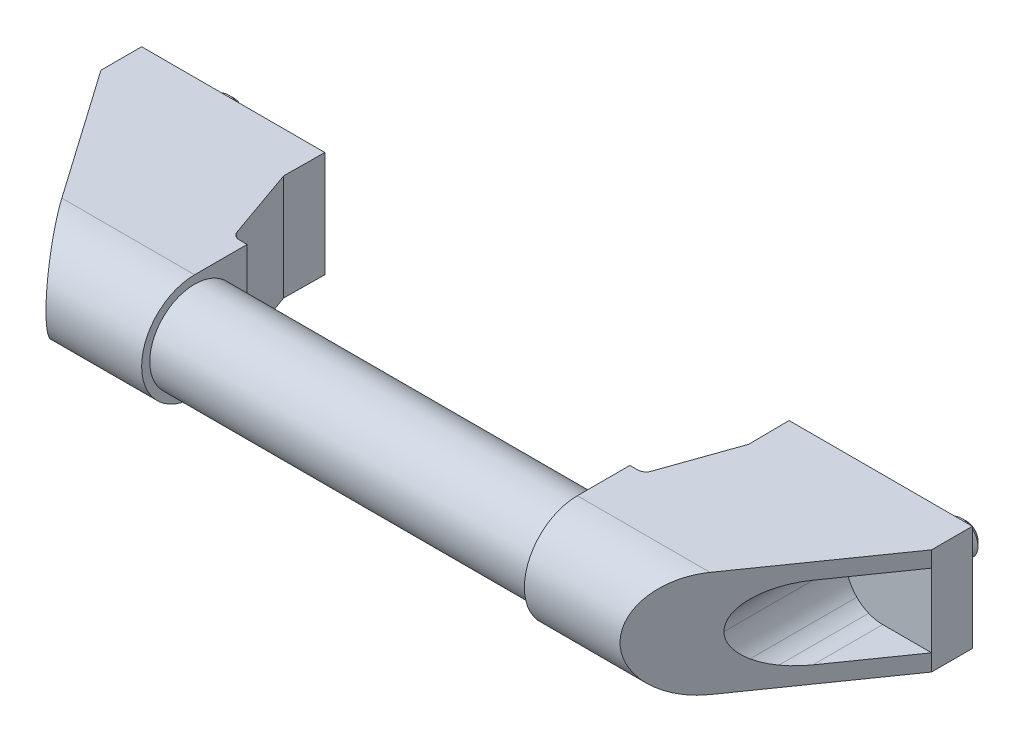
ISO-10303-21;
HEADER;
FILE_DESCRIPTION(('STEP AP214'),'2;1');
FILE_NAME('part.step','',(''),(''),'','','');
FILE_SCHEMA(('AUTOMOTIVE_DESIGN { 1 0 10303 214 1 1 1 1 }'));
ENDSEC;
DATA;
#1=APPLICATION_CONTEXT('core data for automotive mechanical design processes');
#2=APPLICATION_PROTOCOL_DEFINITION('international standard','automotive_design',2000,#1);
#3=PRODUCT_CONTEXT('',#1,'mechanical');
#4=PRODUCT('Part','Part','',(#3));
#5=PRODUCT_RELATED_PRODUCT_CATEGORY('part','',(#4));
#6=PRODUCT_DEFINITION_FORMATION('','',#4);
#7=PRODUCT_DEFINITION_CONTEXT('part definition',#1,'design');
#8=PRODUCT_DEFINITION('design','',#6,#7);
#9=PRODUCT_DEFINITION_SHAPE('','',#8);
#10=(LENGTH_UNIT() NAMED_UNIT(*) SI_UNIT(.MILLI.,.METRE.));
#11=(NAMED_UNIT(*) PLANE_ANGLE_UNIT() SI_UNIT($,.RADIAN.));
#12=(NAMED_UNIT(*) SI_UNIT($,.STERADIAN.) SOLID_ANGLE_UNIT());
#13=UNCERTAINTY_MEASURE_WITH_UNIT(LENGTH_MEASURE(1.E-05),#10,'distance_accuracy_value','');
#14=(GEOMETRIC_REPRESENTATION_CONTEXT(3) GLOBAL_UNCERTAINTY_ASSIGNED_CONTEXT((#13)) GLOBAL_UNIT_ASSIGNED_CONTEXT((#10,
#11,#12)) REPRESENTATION_CONTEXT('',''));
#15=CARTESIAN_POINT('',(0.,0.,0.));
#16=DIRECTION('',(0.,0.,1.));
#17=DIRECTION('',(1.,0.,0.));
#18=AXIS2_PLACEMENT_3D('',#15,#16,#17);
#19=CARTESIAN_POINT('',(137.,0.,42.));
#20=DIRECTION('',(1.,0.,0.));
#21=DIRECTION('',(0.,1.,0.));
#22=AXIS2_PLACEMENT_3D('',#19,#20,#21);
#23=PLANE('',#22);
#24=DIRECTION('',(0.,0.,-1.));
#25=VECTOR('',#24,1.);
#26=CARTESIAN_POINT('',(137.,13.,42.));
#27=LINE('',#26,#25);
#28=CARTESIAN_POINT('',(137.,13.,42.));
#29=VERTEX_POINT('',#28);
#30=CARTESIAN_POINT('',(137.,13.,29.106429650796));
#31=VERTEX_POINT('',#30);
#32=EDGE_CURVE('E609',#29,#31,#27,.T.);
#33=ORIENTED_EDGE('',*,*,#32,.T.);
#34=DIRECTION('',(0.,1.,0.));
#35=VECTOR('',#34,1.);
#36=CARTESIAN_POINT('',(137.,-13.,29.106429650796));
#37=LINE('',#36,#35);
#38=CARTESIAN_POINT('',(137.,-13.,29.106429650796));
#39=VERTEX_POINT('',#38);
#40=EDGE_CURVE('E586',#39,#31,#37,.T.);
#41=ORIENTED_EDGE('',*,*,#40,.F.);
#42=DIRECTION('',(0.,0.,-1.));
#43=VECTOR('',#42,1.);
#44=CARTESIAN_POINT('',(137.,-13.,42.));
#45=LINE('',#44,#43);
#46=CARTESIAN_POINT('',(137.,-13.,42.));
#47=VERTEX_POINT('',#46);
#48=EDGE_CURVE('E612',#47,#39,#45,.T.);
#49=ORIENTED_EDGE('',*,*,#48,.F.);
#50=CARTESIAN_POINT('',(137.,0.,42.));
#51=DIRECTION('',(1.,0.,0.));
#52=DIRECTION('',(0.,1.,0.));
#53=AXIS2_PLACEMENT_3D('',#50,#51,#52);
#54=CIRCLE('',#53,13.);
#55=EDGE_CURVE('E615',#29,#47,#54,.T.);
#56=ORIENTED_EDGE('',*,*,#55,.F.);
#57=EDGE_LOOP('',(#33,#41,#49,#56));
#58=FACE_BOUND('',#57,.T.);
#59=CARTESIAN_POINT('',(137.,0.,42.));
#60=DIRECTION('',(1.,0.,0.));
#61=DIRECTION('',(0.,1.,0.));
#62=AXIS2_PLACEMENT_3D('',#59,#60,#61);
#63=CIRCLE('',#62,11.);
#64=CARTESIAN_POINT('',(137.,11.,42.));
#65=VERTEX_POINT('',#64);
#66=EDGE_CURVE('E9',#65,#65,#63,.F.);
#67=ORIENTED_EDGE('',*,*,#66,.F.);
#68=EDGE_LOOP('',(#67));
#69=FACE_BOUND('',#68,.T.);
#70=ADVANCED_FACE('F14',(#58,#69),#23,.F.);
#71=CARTESIAN_POINT('',(192.,13.,0.));
#72=DIRECTION('',(0.,0.,-1.));
#73=DIRECTION('',(-1.,0.,0.));
#74=AXIS2_PLACEMENT_3D('',#71,#72,#73);
#75=PLANE('',#74);
#76=DIRECTION('',(0.,-1.,0.));
#77=VECTOR('',#76,1.);
#78=CARTESIAN_POINT('',(167.,8.,0.));
#79=LINE('',#78,#77);
#80=CARTESIAN_POINT('',(167.,8.,0.));
#81=VERTEX_POINT('',#80);
#82=CARTESIAN_POINT('',(167.,-8.,0.));
#83=VERTEX_POINT('',#82);
#84=EDGE_CURVE('E496',#81,#83,#79,.T.);
#85=ORIENTED_EDGE('',*,*,#84,.F.);
#86=DIRECTION('',(-1.,0.,0.));
#87=VECTOR('',#86,1.);
#88=CARTESIAN_POINT('',(167.,8.,0.));
#89=LINE('',#88,#87);
#90=CARTESIAN_POINT('',(152.,8.,0.));
#91=VERTEX_POINT('',#90);
#92=EDGE_CURVE('E29',#81,#91,#89,.T.);
#93=ORIENTED_EDGE('',*,*,#92,.T.);
#94=DIRECTION('',(0.,1.,0.));
#95=VECTOR('',#94,1.);
#96=CARTESIAN_POINT('',(152.,-8.,0.));
#97=LINE('',#96,#95);
#98=CARTESIAN_POINT('',(152.,-8.,0.));
#99=VERTEX_POINT('',#98);
#100=EDGE_CURVE('E490',#99,#91,#97,.T.);
#101=ORIENTED_EDGE('',*,*,#100,.F.);
#102=DIRECTION('',(1.,0.,0.));
#103=VECTOR('',#102,1.);
#104=CARTESIAN_POINT('',(152.,-8.,0.));
#105=LINE('',#104,#103);
#106=EDGE_CURVE('E493',#99,#83,#105,.T.);
#107=ORIENTED_EDGE('',*,*,#106,.T.);
#108=EDGE_LOOP('',(#85,#93,#101,#107));
#109=FACE_BOUND('',#108,.T.);
#110=DIRECTION('',(0.,1.,0.));
#111=VECTOR('',#110,1.);
#112=CARTESIAN_POINT('',(147.,-13.,0.));
#113=LINE('',#112,#111);
#114=CARTESIAN_POINT('',(147.,-13.,0.));
#115=VERTEX_POINT('',#114);
#116=CARTESIAN_POINT('',(147.,13.,0.));
#117=VERTEX_POINT('',#116);
#118=EDGE_CURVE('E594',#115,#117,#113,.T.);
#119=ORIENTED_EDGE('',*,*,#118,.T.);
#120=DIRECTION('',(-1.,0.,0.));
#121=VECTOR('',#120,1.);
#122=CARTESIAN_POINT('',(192.,13.,0.));
#123=LINE('',#122,#121);
#124=CARTESIAN_POINT('',(192.,13.,0.));
#125=VERTEX_POINT('',#124);
#126=EDGE_CURVE('E625',#125,#117,#123,.T.);
#127=ORIENTED_EDGE('',*,*,#126,.F.);
#128=DIRECTION('',(0.,-1.,0.));
#129=VECTOR('',#128,1.);
#130=CARTESIAN_POINT('',(192.,13.,0.));
#131=LINE('',#130,#129);
#132=CARTESIAN_POINT('',(192.,-13.,0.));
#133=VERTEX_POINT('',#132);
#134=EDGE_CURVE('E620',#125,#133,#131,.T.);
#135=ORIENTED_EDGE('',*,*,#134,.T.);
#136=DIRECTION('',(-1.,0.,0.));
#137=VECTOR('',#136,1.);
#138=CARTESIAN_POINT('',(192.,-13.,0.));
#139=LINE('',#138,#137);
#140=EDGE_CURVE('E628',#133,#115,#139,.T.);
#141=ORIENTED_EDGE('',*,*,#140,.T.);
#142=EDGE_LOOP('',(#119,#127,#135,#141));
#143=FACE_BOUND('',#142,.T.);
#144=CARTESIAN_POINT('',(180.,0.,0.));
#145=DIRECTION('',(0.,0.,1.));
#146=DIRECTION('',(1.,0.,0.));
#147=AXIS2_PLACEMENT_3D('',#144,#145,#146);
#148=CIRCLE('',#147,4.);
#149=CARTESIAN_POINT('',(184.,0.,0.));
#150=VERTEX_POINT('',#149);
#151=EDGE_CURVE('E480',#150,#150,#148,.T.);
#152=ORIENTED_EDGE('',*,*,#151,.T.);
#153=EDGE_LOOP('',(#152));
#154=FACE_BOUND('',#153,.T.);
#155=ADVANCED_FACE('F693',(#109,#143,#154),#75,.T.);
#156=CARTESIAN_POINT('',(192.,-13.,10.));
#157=DIRECTION('',(-0.819152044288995,0.,-0.573576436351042));
#158=DIRECTION('',(-0.573576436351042,0.,0.819152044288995));
#159=AXIS2_PLACEMENT_3D('',#156,#157,#158);
#160=PLANE('',#159);
#161=DIRECTION('',(0.573576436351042,0.,-0.819152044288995));
#162=VECTOR('',#161,1.);
#163=CARTESIAN_POINT('',(192.,-8.90119415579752,10.));
#164=LINE('',#163,#162);
#165=CARTESIAN_POINT('',(179.999992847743,-8.90119415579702,27.1377862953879));
#166=VERTEX_POINT('',#165);
#167=CARTESIAN_POINT('',(192.,-8.90119415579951,10.));
#168=VERTEX_POINT('',#167);
#169=EDGE_CURVE('E22',#166,#168,#164,.T.);
#170=ORIENTED_EDGE('',*,*,#169,.F.);
#171=CARTESIAN_POINT('',(179.999999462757,0.0988421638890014,27.1377768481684));
#172=DIRECTION('',(-0.819152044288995,0.,-0.573576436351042));
#173=DIRECTION('',(-0.573576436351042,0.,0.819152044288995));
#174=AXIS2_PLACEMENT_3D('',#171,#172,#173);
#175=ELLIPSE('',#174,15.6910844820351,9.00003631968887);
#176=CARTESIAN_POINT('',(176.555841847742,-8.21611015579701,32.0565436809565));
#177=VERTEX_POINT('',#176);
#178=EDGE_CURVE('E653',#166,#177,#175,.T.);
#179=ORIENTED_EDGE('',*,*,#178,.T.);
#180=CARTESIAN_POINT('',(180.000013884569,0.0988360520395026,27.1377562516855));
#181=DIRECTION('',(-0.819152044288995,0.,-0.573576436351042));
#182=DIRECTION('',(-0.573576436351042,0.,0.819152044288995));
#183=AXIS2_PLACEMENT_3D('',#180,#181,#182);
#184=ELLIPSE('',#183,15.6910842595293,9.00003619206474);
#185=CARTESIAN_POINT('',(173.636031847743,-6.26515515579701,36.2264645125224));
#186=VERTEX_POINT('',#185);
#187=EDGE_CURVE('E650',#177,#186,#184,.T.);
#188=ORIENTED_EDGE('',*,*,#187,.T.);
#189=CARTESIAN_POINT('',(180.000032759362,0.0988180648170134,27.1377292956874));
#190=DIRECTION('',(-0.819152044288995,0.,-0.573576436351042));
#191=DIRECTION('',(-0.573576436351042,0.,0.819152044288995));
#192=AXIS2_PLACEMENT_3D('',#189,#190,#191);
#193=ELLIPSE('',#192,15.6910853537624,9.00003681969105);
#194=CARTESIAN_POINT('',(170.999995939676,0.0988089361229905,39.9911139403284));
#195=VERTEX_POINT('',#194);
#196=EDGE_CURVE('E647',#186,#195,#193,.T.);
#197=ORIENTED_EDGE('',*,*,#196,.T.);
#198=CARTESIAN_POINT('',(180.000030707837,0.098790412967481,27.1377322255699));
#199=DIRECTION('',(-0.819152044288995,0.,-0.573576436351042));
#200=DIRECTION('',(-0.573576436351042,0.,0.819152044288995));
#201=AXIS2_PLACEMENT_3D('',#198,#199,#200);
#202=ELLIPSE('',#201,15.6910817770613,9.00003476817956);
#203=CARTESIAN_POINT('',(173.636039,6.4627699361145,36.22645429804));
#204=VERTEX_POINT('',#203);
#205=EDGE_CURVE('E644',#195,#204,#202,.T.);
#206=ORIENTED_EDGE('',*,*,#205,.T.);
#207=CARTESIAN_POINT('',(180.000021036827,0.0987787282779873,27.1377460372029));
#208=DIRECTION('',(-0.819152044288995,0.,-0.573576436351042));
#209=DIRECTION('',(-0.573576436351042,0.,0.819152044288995));
#210=AXIS2_PLACEMENT_3D('',#207,#208,#209);
#211=ELLIPSE('',#210,15.6910842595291,9.00003619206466);
#212=CARTESIAN_POINT('',(176.555849,8.4137249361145,32.0565334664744));
#213=VERTEX_POINT('',#212);
#214=EDGE_CURVE('E641',#204,#213,#211,.T.);
#215=ORIENTED_EDGE('',*,*,#214,.T.);
#216=CARTESIAN_POINT('',(180.000006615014,0.098772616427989,27.1377666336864));
#217=DIRECTION('',(-0.819152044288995,0.,-0.573576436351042));
#218=DIRECTION('',(-0.573576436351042,0.,0.819152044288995));
#219=AXIS2_PLACEMENT_3D('',#216,#217,#218);
#220=ELLIPSE('',#219,15.691084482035,9.0000363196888);
#221=CARTESIAN_POINT('',(180.,9.09880893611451,27.1377760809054));
#222=VERTEX_POINT('',#221);
#223=EDGE_CURVE('E638',#213,#222,#220,.T.);
#224=ORIENTED_EDGE('',*,*,#223,.T.);
#225=DIRECTION('',(0.573576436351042,0.,-0.819152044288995));
#226=VECTOR('',#225,1.);
#227=CARTESIAN_POINT('',(192.,9.09880893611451,10.));
#228=LINE('',#227,#226);
#229=CARTESIAN_POINT('',(192.,9.09880893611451,10.));
#230=VERTEX_POINT('',#229);
#231=EDGE_CURVE('E635',#222,#230,#228,.T.);
#232=ORIENTED_EDGE('',*,*,#231,.T.);
#233=DIRECTION('',(0.,1.,0.));
#234=VECTOR('',#233,1.);
#235=CARTESIAN_POINT('',(192.,-13.,10.));
#236=LINE('',#235,#234);
#237=CARTESIAN_POINT('',(192.,13.,10.));
#238=VERTEX_POINT('',#237);
#239=EDGE_CURVE('E603',#230,#238,#236,.T.);
#240=ORIENTED_EDGE('',*,*,#239,.T.);
#241=DIRECTION('',(-0.573576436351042,0.,0.819152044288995));
#242=VECTOR('',#241,1.);
#243=CARTESIAN_POINT('',(192.,13.,10.));
#244=LINE('',#243,#242);
#245=CARTESIAN_POINT('',(169.59335877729,13.,42.));
#246=VERTEX_POINT('',#245);
#247=EDGE_CURVE('E597',#238,#246,#244,.T.);
#248=ORIENTED_EDGE('',*,*,#247,.T.);
#249=CARTESIAN_POINT('',(169.59335877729,0.,42.));
#250=DIRECTION('',(-0.819152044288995,0.,-0.573576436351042));
#251=DIRECTION('',(-0.573576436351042,0.,0.819152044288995));
#252=AXIS2_PLACEMENT_3D('',#249,#250,#251);
#253=ELLIPSE('',#252,15.8700696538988,13.);
#254=CARTESIAN_POINT('',(169.59335877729,-13.,42.));
#255=VERTEX_POINT('',#254);
#256=EDGE_CURVE('E607',#255,#246,#253,.T.);
#257=ORIENTED_EDGE('',*,*,#256,.F.);
#258=DIRECTION('',(-0.573576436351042,0.,0.819152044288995));
#259=VECTOR('',#258,1.);
#260=CARTESIAN_POINT('',(192.,-13.,10.));
#261=LINE('',#260,#259);
#262=CARTESIAN_POINT('',(192.,-13.,10.));
#263=VERTEX_POINT('',#262);
#264=EDGE_CURVE('E600',#263,#255,#261,.T.);
#265=ORIENTED_EDGE('',*,*,#264,.F.);
#266=EDGE_CURVE('E604',#263,#168,#236,.T.);
#267=ORIENTED_EDGE('',*,*,#266,.T.);
#268=EDGE_LOOP('',(#170,#179,#188,#197,#206,#215,#224,#232,#240,#248,#257,#265,#267));
#269=FACE_BOUND('',#268,.T.);
#270=ADVANCED_FACE('F666',(#269),#160,.F.);
#271=CARTESIAN_POINT('',(192.,13.,42.));
#272=DIRECTION('',(0.,1.,0.));
#273=DIRECTION('',(-1.,0.,0.));
#274=AXIS2_PLACEMENT_3D('',#271,#272,#273);
#275=PLANE('',#274);
#276=DIRECTION('',(-0.0104830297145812,0.,-0.999945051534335));
#277=VECTOR('',#276,1.);
#278=CARTESIAN_POINT('',(147.104830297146,13.,9.99945051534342));
#279=LINE('',#278,#277);
#280=CARTESIAN_POINT('',(147.104830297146,13.,9.99945051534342));
#281=VERTEX_POINT('',#280);
#282=EDGE_CURVE('E572',#281,#117,#279,.T.);
#283=ORIENTED_EDGE('',*,*,#282,.F.);
#284=DIRECTION('',(-0.332150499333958,0.,0.943226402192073));
#285=VECTOR('',#284,1.);
#286=CARTESIAN_POINT('',(147.104830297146,13.,9.99945051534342));
#287=LINE('',#286,#285);
#288=CARTESIAN_POINT('',(140.854102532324,13.,27.7499927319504));
#289=VERTEX_POINT('',#288);
#290=EDGE_CURVE('E569',#281,#289,#287,.T.);
#291=ORIENTED_EDGE('',*,*,#290,.T.);
#292=CARTESIAN_POINT('',(138.967649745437,13.,27.085691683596));
#293=DIRECTION('',(0.,1.,0.));
#294=DIRECTION('',(-1.,0.,0.));
#295=AXIS2_PLACEMENT_3D('',#292,#293,#294);
#296=CIRCLE('',#295,2.);
#297=CARTESIAN_POINT('',(138.988615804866,13.,29.0855817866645));
#298=VERTEX_POINT('',#297);
#299=EDGE_CURVE('E566',#298,#289,#296,.T.);
#300=ORIENTED_EDGE('',*,*,#299,.F.);
#301=DIRECTION('',(0.999945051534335,0.,-0.0104830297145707));
#302=VECTOR('',#301,1.);
#303=CARTESIAN_POINT('',(137.,13.,29.106429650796));
#304=LINE('',#303,#302);
#305=EDGE_CURVE('E563',#31,#298,#304,.T.);
#306=ORIENTED_EDGE('',*,*,#305,.F.);
#307=ORIENTED_EDGE('',*,*,#32,.F.);
#308=DIRECTION('',(-1.,0.,0.));
#309=VECTOR('',#308,1.);
#310=CARTESIAN_POINT('',(192.,13.,42.));
#311=LINE('',#310,#309);
#312=EDGE_CURVE('E633',#246,#29,#311,.T.);
#313=ORIENTED_EDGE('',*,*,#312,.F.);
#314=ORIENTED_EDGE('',*,*,#247,.F.);
#315=DIRECTION('',(0.,0.,-1.));
#316=VECTOR('',#315,1.);
#317=CARTESIAN_POINT('',(192.,13.,42.));
#318=LINE('',#317,#316);
#319=EDGE_CURVE('E618',#238,#125,#318,.T.);
#320=ORIENTED_EDGE('',*,*,#319,.T.);
#321=ORIENTED_EDGE('',*,*,#126,.T.);
#322=EDGE_LOOP('',(#283,#291,#300,#306,#307,#313,#314,#320,#321));
#323=FACE_BOUND('',#322,.T.);
#324=ADVANCED_FACE('F700',(#323),#275,.T.);
#325=CARTESIAN_POINT('',(192.,0.,42.));
#326=DIRECTION('',(-1.,0.,0.));
#327=DIRECTION('',(0.,-1.,0.));
#328=AXIS2_PLACEMENT_3D('',#325,#326,#327);
#329=CYLINDRICAL_SURFACE('',#328,13.);
#330=ORIENTED_EDGE('',*,*,#256,.T.);
#331=ORIENTED_EDGE('',*,*,#312,.T.);
#332=ORIENTED_EDGE('',*,*,#55,.T.);
#333=DIRECTION('',(-1.,0.,0.));
#334=VECTOR('',#333,1.);
#335=CARTESIAN_POINT('',(192.,-13.,42.));
#336=LINE('',#335,#334);
#337=EDGE_CURVE('E631',#255,#47,#336,.T.);
#338=ORIENTED_EDGE('',*,*,#337,.F.);
#339=EDGE_LOOP('',(#330,#331,#332,#338));
#340=FACE_BOUND('',#339,.T.);
#341=ADVANCED_FACE('F16',(#340),#329,.T.);
#342=CARTESIAN_POINT('',(192.,-13.,42.));
#343=DIRECTION('',(0.,1.,0.));
#344=DIRECTION('',(-1.,0.,0.));
#345=AXIS2_PLACEMENT_3D('',#342,#343,#344);
#346=PLANE('',#345);
#347=DIRECTION('',(-0.332150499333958,0.,0.943226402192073));
#348=VECTOR('',#347,1.);
#349=CARTESIAN_POINT('',(147.104830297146,-13.,9.99945051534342));
#350=LINE('',#349,#348);
#351=CARTESIAN_POINT('',(147.104830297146,-13.,9.99945051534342));
#352=VERTEX_POINT('',#351);
#353=CARTESIAN_POINT('',(140.854102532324,-13.,27.7499927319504));
#354=VERTEX_POINT('',#353);
#355=EDGE_CURVE('E580',#352,#354,#350,.T.);
#356=ORIENTED_EDGE('',*,*,#355,.F.);
#357=DIRECTION('',(-0.0104830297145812,0.,-0.999945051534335));
#358=VECTOR('',#357,1.);
#359=CARTESIAN_POINT('',(147.104830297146,-13.,9.99945051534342));
#360=LINE('',#359,#358);
#361=EDGE_CURVE('E583',#352,#115,#360,.T.);
#362=ORIENTED_EDGE('',*,*,#361,.T.);
#363=ORIENTED_EDGE('',*,*,#140,.F.);
#364=DIRECTION('',(0.,0.,-1.));
#365=VECTOR('',#364,1.);
#366=CARTESIAN_POINT('',(192.,-13.,42.));
#367=LINE('',#366,#365);
#368=EDGE_CURVE('E623',#263,#133,#367,.T.);
#369=ORIENTED_EDGE('',*,*,#368,.F.);
#370=ORIENTED_EDGE('',*,*,#264,.T.);
#371=ORIENTED_EDGE('',*,*,#337,.T.);
#372=ORIENTED_EDGE('',*,*,#48,.T.);
#373=DIRECTION('',(0.999945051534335,0.,-0.0104830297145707));
#374=VECTOR('',#373,1.);
#375=CARTESIAN_POINT('',(137.,-13.,29.106429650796));
#376=LINE('',#375,#374);
#377=CARTESIAN_POINT('',(138.988615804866,-13.,29.0855817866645));
#378=VERTEX_POINT('',#377);
#379=EDGE_CURVE('E574',#39,#378,#376,.T.);
#380=ORIENTED_EDGE('',*,*,#379,.T.);
#381=CARTESIAN_POINT('',(138.967649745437,-13.,27.085691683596));
#382=DIRECTION('',(0.,1.,0.));
#383=DIRECTION('',(-1.,0.,0.));
#384=AXIS2_PLACEMENT_3D('',#381,#382,#383);
#385=CIRCLE('',#384,2.);
#386=EDGE_CURVE('E577',#378,#354,#385,.T.);
#387=ORIENTED_EDGE('',*,*,#386,.T.);
#388=EDGE_LOOP('',(#356,#362,#363,#369,#370,#371,#372,#380,#387));
#389=FACE_BOUND('',#388,.T.);
#390=ADVANCED_FACE('F670',(#389),#346,.F.);
#391=CARTESIAN_POINT('',(192.,0.,42.));
#392=DIRECTION('',(1.,0.,0.));
#393=DIRECTION('',(0.,1.,0.));
#394=AXIS2_PLACEMENT_3D('',#391,#392,#393);
#395=PLANE('',#394);
#396=ORIENTED_EDGE('',*,*,#266,.F.);
#397=ORIENTED_EDGE('',*,*,#368,.T.);
#398=ORIENTED_EDGE('',*,*,#134,.F.);
#399=ORIENTED_EDGE('',*,*,#319,.F.);
#400=ORIENTED_EDGE('',*,*,#239,.F.);
#401=DIRECTION('',(0.,1.,0.));
#402=VECTOR('',#401,1.);
#403=CARTESIAN_POINT('',(192.,-8.90119415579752,10.));
#404=LINE('',#403,#402);
#405=EDGE_CURVE('E540',#168,#230,#404,.T.);
#406=ORIENTED_EDGE('',*,*,#405,.F.);
#407=EDGE_LOOP('',(#396,#397,#398,#399,#400,#406));
#408=FACE_BOUND('',#407,.T.);
#409=ADVANCED_FACE('F663',(#408),#395,.T.);
#410=CARTESIAN_POINT('',(147.104830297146,-13.,9.99945051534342));
#411=DIRECTION('',(0.999945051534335,0.,-0.0104830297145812));
#412=DIRECTION('',(-0.0104830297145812,0.,-0.999945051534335));
#413=AXIS2_PLACEMENT_3D('',#410,#411,#412);
#414=PLANE('',#413);
#415=DIRECTION('',(0.,1.,0.));
#416=VECTOR('',#415,1.);
#417=CARTESIAN_POINT('',(147.104830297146,-13.,9.99945051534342));
#418=LINE('',#417,#416);
#419=EDGE_CURVE('E592',#352,#281,#418,.T.);
#420=ORIENTED_EDGE('',*,*,#419,.T.);
#421=ORIENTED_EDGE('',*,*,#282,.T.);
#422=ORIENTED_EDGE('',*,*,#118,.F.);
#423=ORIENTED_EDGE('',*,*,#361,.F.);
#424=EDGE_LOOP('',(#420,#421,#422,#423));
#425=FACE_BOUND('',#424,.T.);
#426=ADVANCED_FACE('F735',(#425),#414,.F.);
#427=CARTESIAN_POINT('',(147.104830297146,-13.,9.99945051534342));
#428=DIRECTION('',(-0.943226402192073,0.,-0.332150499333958));
#429=DIRECTION('',(-0.332150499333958,0.,0.943226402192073));
#430=AXIS2_PLACEMENT_3D('',#427,#428,#429);
#431=PLANE('',#430);
#432=DIRECTION('',(0.,1.,0.));
#433=VECTOR('',#432,1.);
#434=CARTESIAN_POINT('',(140.854102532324,-13.,27.7499927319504));
#435=LINE('',#434,#433);
#436=EDGE_CURVE('E590',#354,#289,#435,.T.);
#437=ORIENTED_EDGE('',*,*,#436,.T.);
#438=ORIENTED_EDGE('',*,*,#290,.F.);
#439=ORIENTED_EDGE('',*,*,#419,.F.);
#440=ORIENTED_EDGE('',*,*,#355,.T.);
#441=EDGE_LOOP('',(#437,#438,#439,#440));
#442=FACE_BOUND('',#441,.T.);
#443=ADVANCED_FACE('F689',(#442),#431,.T.);
#444=CARTESIAN_POINT('',(138.967649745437,-13.,27.085691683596));
#445=DIRECTION('',(0.,1.,0.));
#446=DIRECTION('',(-1.,0.,0.));
#447=AXIS2_PLACEMENT_3D('',#444,#445,#446);
#448=CYLINDRICAL_SURFACE('',#447,2.);
#449=DIRECTION('',(0.,1.,0.));
#450=VECTOR('',#449,1.);
#451=CARTESIAN_POINT('',(138.988615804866,-13.,29.0855817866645));
#452=LINE('',#451,#450);
#453=EDGE_CURVE('E588',#378,#298,#452,.T.);
#454=ORIENTED_EDGE('',*,*,#453,.T.);
#455=ORIENTED_EDGE('',*,*,#299,.T.);
#456=ORIENTED_EDGE('',*,*,#436,.F.);
#457=ORIENTED_EDGE('',*,*,#386,.F.);
#458=EDGE_LOOP('',(#454,#455,#456,#457));
#459=FACE_BOUND('',#458,.T.);
#460=ADVANCED_FACE('F686',(#459),#448,.F.);
#461=CARTESIAN_POINT('',(137.,-13.,29.106429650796));
#462=DIRECTION('',(0.0104830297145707,0.,0.999945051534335));
#463=DIRECTION('',(0.999945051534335,0.,-0.0104830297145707));
#464=AXIS2_PLACEMENT_3D('',#461,#462,#463);
#465=PLANE('',#464);
#466=ORIENTED_EDGE('',*,*,#40,.T.);
#467=ORIENTED_EDGE('',*,*,#305,.T.);
#468=ORIENTED_EDGE('',*,*,#453,.F.);
#469=ORIENTED_EDGE('',*,*,#379,.F.);
#470=EDGE_LOOP('',(#466,#467,#468,#469));
#471=FACE_BOUND('',#470,.T.);
#472=ADVANCED_FACE('F682',(#471),#465,.F.);
#473=CARTESIAN_POINT('',(192.,-8.90119415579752,10.));
#474=DIRECTION('',(0.,1.,0.));
#475=DIRECTION('',(-1.,0.,0.));
#476=AXIS2_PLACEMENT_3D('',#473,#474,#475);
#477=PLANE('',#476);
#478=ORIENTED_EDGE('',*,*,#169,.T.);
#479=DIRECTION('',(-1.,0.,0.));
#480=VECTOR('',#479,1.);
#481=CARTESIAN_POINT('',(192.,-8.90119415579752,10.));
#482=LINE('',#481,#480);
#483=CARTESIAN_POINT('',(179.999992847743,-8.90119415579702,10.));
#484=VERTEX_POINT('',#483);
#485=EDGE_CURVE('E37',#168,#484,#482,.T.);
#486=ORIENTED_EDGE('',*,*,#485,.T.);
#487=DIRECTION('',(0.,0.,1.));
#488=VECTOR('',#487,1.);
#489=CARTESIAN_POINT('',(179.999992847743,-8.90119415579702,10.));
#490=LINE('',#489,#488);
#491=EDGE_CURVE('E560',#484,#166,#490,.T.);
#492=ORIENTED_EDGE('',*,*,#491,.T.);
#493=EDGE_LOOP('',(#478,#486,#492));
#494=FACE_BOUND('',#493,.T.);
#495=ADVANCED_FACE('F658',(#494),#477,.T.);
#496=CARTESIAN_POINT('',(179.999999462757,0.0988421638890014,10.));
#497=DIRECTION('',(0.,0.,1.));
#498=DIRECTION('',(1.,0.,0.));
#499=AXIS2_PLACEMENT_3D('',#496,#497,#498);
#500=CYLINDRICAL_SURFACE('',#499,9.00003631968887);
#501=ORIENTED_EDGE('',*,*,#491,.F.);
#502=CARTESIAN_POINT('',(179.999999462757,0.0988421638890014,10.));
#503=DIRECTION('',(0.,0.,1.));
#504=DIRECTION('',(1.,0.,0.));
#505=AXIS2_PLACEMENT_3D('',#502,#503,#504);
#506=CIRCLE('',#505,9.00003631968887);
#507=CARTESIAN_POINT('',(176.555841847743,-8.21611015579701,10.));
#508=VERTEX_POINT('',#507);
#509=EDGE_CURVE('E520',#508,#484,#506,.T.);
#510=ORIENTED_EDGE('',*,*,#509,.F.);
#511=DIRECTION('',(0.,0.,1.));
#512=VECTOR('',#511,1.);
#513=CARTESIAN_POINT('',(176.555841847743,-8.21611015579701,10.));
#514=LINE('',#513,#512);
#515=EDGE_CURVE('E557',#508,#177,#514,.T.);
#516=ORIENTED_EDGE('',*,*,#515,.T.);
#517=ORIENTED_EDGE('',*,*,#178,.F.);
#518=EDGE_LOOP('',(#501,#510,#516,#517));
#519=FACE_BOUND('',#518,.T.);
#520=ADVANCED_FACE('F812',(#519),#500,.F.);
#521=CARTESIAN_POINT('',(180.000013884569,0.0988360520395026,10.));
#522=DIRECTION('',(0.,0.,1.));
#523=DIRECTION('',(1.,0.,0.));
#524=AXIS2_PLACEMENT_3D('',#521,#522,#523);
#525=CYLINDRICAL_SURFACE('',#524,9.00003619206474);
#526=ORIENTED_EDGE('',*,*,#515,.F.);
#527=CARTESIAN_POINT('',(180.000013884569,0.0988360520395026,10.));
#528=DIRECTION('',(0.,0.,1.));
#529=DIRECTION('',(1.,0.,0.));
#530=AXIS2_PLACEMENT_3D('',#527,#528,#529);
#531=CIRCLE('',#530,9.00003619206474);
#532=CARTESIAN_POINT('',(173.636031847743,-6.26515515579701,10.));
#533=VERTEX_POINT('',#532);
#534=EDGE_CURVE('E522',#533,#508,#531,.T.);
#535=ORIENTED_EDGE('',*,*,#534,.F.);
#536=DIRECTION('',(0.,0.,1.));
#537=VECTOR('',#536,1.);
#538=CARTESIAN_POINT('',(173.636031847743,-6.26515515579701,10.));
#539=LINE('',#538,#537);
#540=EDGE_CURVE('E554',#533,#186,#539,.T.);
#541=ORIENTED_EDGE('',*,*,#540,.T.);
#542=ORIENTED_EDGE('',*,*,#187,.F.);
#543=EDGE_LOOP('',(#526,#535,#541,#542));
#544=FACE_BOUND('',#543,.T.);
#545=ADVANCED_FACE('F819',(#544),#525,.F.);
#546=CARTESIAN_POINT('',(180.000032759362,0.0988180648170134,10.));
#547=DIRECTION('',(0.,0.,1.));
#548=DIRECTION('',(1.,0.,0.));
#549=AXIS2_PLACEMENT_3D('',#546,#547,#548);
#550=CYLINDRICAL_SURFACE('',#549,9.00003681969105);
#551=ORIENTED_EDGE('',*,*,#540,.F.);
#552=CARTESIAN_POINT('',(180.000032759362,0.0988180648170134,10.));
#553=DIRECTION('',(0.,0.,1.));
#554=DIRECTION('',(1.,0.,0.));
#555=AXIS2_PLACEMENT_3D('',#552,#553,#554);
#556=CIRCLE('',#555,9.00003681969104);
#557=CARTESIAN_POINT('',(170.999995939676,0.0988089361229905,10.));
#558=VERTEX_POINT('',#557);
#559=EDGE_CURVE('E525',#558,#533,#556,.T.);
#560=ORIENTED_EDGE('',*,*,#559,.F.);
#561=DIRECTION('',(0.,0.,1.));
#562=VECTOR('',#561,1.);
#563=CARTESIAN_POINT('',(170.999995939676,0.0988089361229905,10.));
#564=LINE('',#563,#562);
#565=EDGE_CURVE('E551',#558,#195,#564,.T.);
#566=ORIENTED_EDGE('',*,*,#565,.T.);
#567=ORIENTED_EDGE('',*,*,#196,.F.);
#568=EDGE_LOOP('',(#551,#560,#566,#567));
#569=FACE_BOUND('',#568,.T.);
#570=ADVANCED_FACE('F828',(#569),#550,.F.);
#571=CARTESIAN_POINT('',(180.000030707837,0.098790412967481,10.));
#572=DIRECTION('',(0.,0.,1.));
#573=DIRECTION('',(1.,0.,0.));
#574=AXIS2_PLACEMENT_3D('',#571,#572,#573);
#575=CYLINDRICAL_SURFACE('',#574,9.00003476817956);
#576=ORIENTED_EDGE('',*,*,#565,.F.);
#577=CARTESIAN_POINT('',(180.000030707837,0.098790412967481,10.));
#578=DIRECTION('',(0.,0.,1.));
#579=DIRECTION('',(1.,0.,0.));
#580=AXIS2_PLACEMENT_3D('',#577,#578,#579);
#581=CIRCLE('',#580,9.00003476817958);
#582=CARTESIAN_POINT('',(173.636039,6.4627699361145,10.));
#583=VERTEX_POINT('',#582);
#584=EDGE_CURVE('E528',#583,#558,#581,.T.);
#585=ORIENTED_EDGE('',*,*,#584,.F.);
#586=DIRECTION('',(0.,0.,1.));
#587=VECTOR('',#586,1.);
#588=CARTESIAN_POINT('',(173.636039,6.4627699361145,10.));
#589=LINE('',#588,#587);
#590=EDGE_CURVE('E548',#583,#204,#589,.T.);
#591=ORIENTED_EDGE('',*,*,#590,.T.);
#592=ORIENTED_EDGE('',*,*,#205,.F.);
#593=EDGE_LOOP('',(#576,#585,#591,#592));
#594=FACE_BOUND('',#593,.T.);
#595=ADVANCED_FACE('F837',(#594),#575,.F.);
#596=CARTESIAN_POINT('',(180.000021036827,0.0987787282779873,10.));
#597=DIRECTION('',(0.,0.,1.));
#598=DIRECTION('',(1.,0.,0.));
#599=AXIS2_PLACEMENT_3D('',#596,#597,#598);
#600=CYLINDRICAL_SURFACE('',#599,9.00003619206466);
#601=ORIENTED_EDGE('',*,*,#590,.F.);
#602=CARTESIAN_POINT('',(180.000021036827,0.0987787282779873,10.));
#603=DIRECTION('',(0.,0.,1.));
#604=DIRECTION('',(1.,0.,0.));
#605=AXIS2_PLACEMENT_3D('',#602,#603,#604);
#606=CIRCLE('',#605,9.00003619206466);
#607=CARTESIAN_POINT('',(176.555849,8.4137249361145,10.));
#608=VERTEX_POINT('',#607);
#609=EDGE_CURVE('E531',#608,#583,#606,.T.);
#610=ORIENTED_EDGE('',*,*,#609,.F.);
#611=DIRECTION('',(0.,0.,1.));
#612=VECTOR('',#611,1.);
#613=CARTESIAN_POINT('',(176.555849,8.4137249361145,10.));
#614=LINE('',#613,#612);
#615=EDGE_CURVE('E545',#608,#213,#614,.T.);
#616=ORIENTED_EDGE('',*,*,#615,.T.);
#617=ORIENTED_EDGE('',*,*,#214,.F.);
#618=EDGE_LOOP('',(#601,#610,#616,#617));
#619=FACE_BOUND('',#618,.T.);
#620=ADVANCED_FACE('F846',(#619),#600,.F.);
#621=CARTESIAN_POINT('',(180.000006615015,0.098772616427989,10.));
#622=DIRECTION('',(0.,0.,1.));
#623=DIRECTION('',(1.,0.,0.));
#624=AXIS2_PLACEMENT_3D('',#621,#622,#623);
#625=CYLINDRICAL_SURFACE('',#624,9.0000363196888);
#626=ORIENTED_EDGE('',*,*,#615,.F.);
#627=CARTESIAN_POINT('',(180.000006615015,0.098772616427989,10.));
#628=DIRECTION('',(0.,0.,1.));
#629=DIRECTION('',(1.,0.,0.));
#630=AXIS2_PLACEMENT_3D('',#627,#628,#629);
#631=CIRCLE('',#630,9.0000363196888);
#632=CARTESIAN_POINT('',(180.,9.09880893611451,10.));
#633=VERTEX_POINT('',#632);
#634=EDGE_CURVE('E534',#633,#608,#631,.T.);
#635=ORIENTED_EDGE('',*,*,#634,.F.);
#636=DIRECTION('',(0.,0.,1.));
#637=VECTOR('',#636,1.);
#638=CARTESIAN_POINT('',(180.,9.09880893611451,10.));
#639=LINE('',#638,#637);
#640=EDGE_CURVE('E542',#633,#222,#639,.T.);
#641=ORIENTED_EDGE('',*,*,#640,.T.);
#642=ORIENTED_EDGE('',*,*,#223,.F.);
#643=EDGE_LOOP('',(#626,#635,#641,#642));
#644=FACE_BOUND('',#643,.T.);
#645=ADVANCED_FACE('F705',(#644),#625,.F.);
#646=CARTESIAN_POINT('',(192.,9.09880893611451,10.));
#647=DIRECTION('',(0.,1.,0.));
#648=DIRECTION('',(-1.,0.,0.));
#649=AXIS2_PLACEMENT_3D('',#646,#647,#648);
#650=PLANE('',#649);
#651=ORIENTED_EDGE('',*,*,#640,.F.);
#652=DIRECTION('',(-1.,0.,0.));
#653=VECTOR('',#652,1.);
#654=CARTESIAN_POINT('',(192.,9.09880893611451,10.));
#655=LINE('',#654,#653);
#656=EDGE_CURVE('E537',#230,#633,#655,.T.);
#657=ORIENTED_EDGE('',*,*,#656,.F.);
#658=ORIENTED_EDGE('',*,*,#231,.F.);
#659=EDGE_LOOP('',(#651,#657,#658));
#660=FACE_BOUND('',#659,.T.);
#661=ADVANCED_FACE('F702',(#660),#650,.F.);
#662=CARTESIAN_POINT('',(179.999999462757,0.0988421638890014,10.));
#663=DIRECTION('',(0.,0.,1.));
#664=DIRECTION('',(1.,0.,0.));
#665=AXIS2_PLACEMENT_3D('',#662,#663,#664);
#666=PLANE('',#665);
#667=ORIENTED_EDGE('',*,*,#485,.F.);
#668=ORIENTED_EDGE('',*,*,#405,.T.);
#669=ORIENTED_EDGE('',*,*,#656,.T.);
#670=ORIENTED_EDGE('',*,*,#634,.T.);
#671=ORIENTED_EDGE('',*,*,#609,.T.);
#672=ORIENTED_EDGE('',*,*,#584,.T.);
#673=ORIENTED_EDGE('',*,*,#559,.T.);
#674=ORIENTED_EDGE('',*,*,#534,.T.);
#675=ORIENTED_EDGE('',*,*,#509,.T.);
#676=EDGE_LOOP('',(#667,#668,#669,#670,#671,#672,#673,#674,#675));
#677=FACE_BOUND('',#676,.T.);
#678=ADVANCED_FACE('F707',(#677),#666,.T.);
#679=CARTESIAN_POINT('',(167.,8.,30.));
#680=DIRECTION('',(0.,-1.,0.));
#681=DIRECTION('',(1.,0.,0.));
#682=AXIS2_PLACEMENT_3D('',#679,#680,#681);
#683=PLANE('',#682);
#684=DIRECTION('',(0.,0.,-1.));
#685=VECTOR('',#684,1.);
#686=CARTESIAN_POINT('',(152.,8.,30.));
#687=LINE('',#686,#685);
#688=CARTESIAN_POINT('',(152.,8.,30.));
#689=VERTEX_POINT('',#688);
#690=EDGE_CURVE('E517',#689,#91,#687,.T.);
#691=ORIENTED_EDGE('',*,*,#690,.T.);
#692=ORIENTED_EDGE('',*,*,#92,.F.);
#693=DIRECTION('',(0.,0.,-1.));
#694=VECTOR('',#693,1.);
#695=CARTESIAN_POINT('',(167.,8.,30.));
#696=LINE('',#695,#694);
#697=CARTESIAN_POINT('',(167.,8.,30.));
#698=VERTEX_POINT('',#697);
#699=EDGE_CURVE('E511',#698,#81,#696,.T.);
#700=ORIENTED_EDGE('',*,*,#699,.F.);
#701=DIRECTION('',(-1.,0.,0.));
#702=VECTOR('',#701,1.);
#703=CARTESIAN_POINT('',(167.,8.,30.));
#704=LINE('',#703,#702);
#705=EDGE_CURVE('E499',#698,#689,#704,.T.);
#706=ORIENTED_EDGE('',*,*,#705,.T.);
#707=EDGE_LOOP('',(#691,#692,#700,#706));
#708=FACE_BOUND('',#707,.T.);
#709=ADVANCED_FACE('F709',(#708),#683,.T.);
#710=CARTESIAN_POINT('',(152.,-8.,30.));
#711=DIRECTION('',(-1.,0.,0.));
#712=DIRECTION('',(0.,-1.,0.));
#713=AXIS2_PLACEMENT_3D('',#710,#711,#712);
#714=PLANE('',#713);
#715=DIRECTION('',(0.,0.,-1.));
#716=VECTOR('',#715,1.);
#717=CARTESIAN_POINT('',(152.,-8.,30.));
#718=LINE('',#717,#716);
#719=CARTESIAN_POINT('',(152.,-8.,30.));
#720=VERTEX_POINT('',#719);
#721=EDGE_CURVE('E515',#720,#99,#718,.T.);
#722=ORIENTED_EDGE('',*,*,#721,.T.);
#723=ORIENTED_EDGE('',*,*,#100,.T.);
#724=ORIENTED_EDGE('',*,*,#690,.F.);
#725=DIRECTION('',(0.,1.,0.));
#726=VECTOR('',#725,1.);
#727=CARTESIAN_POINT('',(152.,-8.,30.));
#728=LINE('',#727,#726);
#729=EDGE_CURVE('E502',#720,#689,#728,.T.);
#730=ORIENTED_EDGE('',*,*,#729,.F.);
#731=EDGE_LOOP('',(#722,#723,#724,#730));
#732=FACE_BOUND('',#731,.T.);
#733=ADVANCED_FACE('F717',(#732),#714,.F.);
#734=CARTESIAN_POINT('',(152.,-8.,30.));
#735=DIRECTION('',(0.,1.,0.));
#736=DIRECTION('',(-1.,0.,0.));
#737=AXIS2_PLACEMENT_3D('',#734,#735,#736);
#738=PLANE('',#737);
#739=DIRECTION('',(0.,0.,-1.));
#740=VECTOR('',#739,1.);
#741=CARTESIAN_POINT('',(167.,-8.,30.));
#742=LINE('',#741,#740);
#743=CARTESIAN_POINT('',(167.,-8.,30.));
#744=VERTEX_POINT('',#743);
#745=EDGE_CURVE('E513',#744,#83,#742,.T.);
#746=ORIENTED_EDGE('',*,*,#745,.T.);
#747=ORIENTED_EDGE('',*,*,#106,.F.);
#748=ORIENTED_EDGE('',*,*,#721,.F.);
#749=DIRECTION('',(1.,0.,0.));
#750=VECTOR('',#749,1.);
#751=CARTESIAN_POINT('',(152.,-8.,30.));
#752=LINE('',#751,#750);
#753=EDGE_CURVE('E505',#720,#744,#752,.T.);
#754=ORIENTED_EDGE('',*,*,#753,.T.);
#755=EDGE_LOOP('',(#746,#747,#748,#754));
#756=FACE_BOUND('',#755,.T.);
#757=ADVANCED_FACE('F886',(#756),#738,.T.);
#758=CARTESIAN_POINT('',(167.,8.,30.));
#759=DIRECTION('',(1.,0.,0.));
#760=DIRECTION('',(0.,1.,0.));
#761=AXIS2_PLACEMENT_3D('',#758,#759,#760);
#762=PLANE('',#761);
#763=DIRECTION('',(0.,-1.,0.));
#764=VECTOR('',#763,1.);
#765=CARTESIAN_POINT('',(167.,8.,30.));
#766=LINE('',#765,#764);
#767=EDGE_CURVE('E508',#698,#744,#766,.T.);
#768=ORIENTED_EDGE('',*,*,#767,.F.);
#769=ORIENTED_EDGE('',*,*,#699,.T.);
#770=ORIENTED_EDGE('',*,*,#84,.T.);
#771=ORIENTED_EDGE('',*,*,#745,.F.);
#772=EDGE_LOOP('',(#768,#769,#770,#771));
#773=FACE_BOUND('',#772,.T.);
#774=ADVANCED_FACE('F893',(#773),#762,.F.);
#775=CARTESIAN_POINT('',(152.,8.,30.));
#776=DIRECTION('',(0.,0.,-1.));
#777=DIRECTION('',(-1.,0.,0.));
#778=AXIS2_PLACEMENT_3D('',#775,#776,#777);
#779=PLANE('',#778);
#780=ORIENTED_EDGE('',*,*,#705,.F.);
#781=ORIENTED_EDGE('',*,*,#767,.T.);
#782=ORIENTED_EDGE('',*,*,#753,.F.);
#783=ORIENTED_EDGE('',*,*,#729,.T.);
#784=EDGE_LOOP('',(#780,#781,#782,#783));
#785=FACE_BOUND('',#784,.T.);
#786=ADVANCED_FACE('F896',(#785),#779,.T.);
#787=CARTESIAN_POINT('',(180.,0.,-10.6));
#788=DIRECTION('',(0.,0.,1.));
#789=DIRECTION('',(1.,0.,0.));
#790=AXIS2_PLACEMENT_3D('',#787,#788,#789);
#791=PLANE('',#790);
#792=CARTESIAN_POINT('',(180.,0.,-10.6));
#793=DIRECTION('',(0.,0.,1.));
#794=DIRECTION('',(1.,0.,0.));
#795=AXIS2_PLACEMENT_3D('',#792,#793,#794);
#796=CIRCLE('',#795,2.8);
#797=CARTESIAN_POINT('',(182.8,0.,-10.6));
#798=VERTEX_POINT('',#797);
#799=EDGE_CURVE('E486',#798,#798,#796,.T.);
#800=ORIENTED_EDGE('',*,*,#799,.F.);
#801=EDGE_LOOP('',(#800));
#802=FACE_BOUND('',#801,.T.);
#803=ADVANCED_FACE('F905',(#802),#791,.F.);
#804=CARTESIAN_POINT('',(180.,0.,-10.6));
#805=DIRECTION('',(0.,0.,1.));
#806=DIRECTION('',(1.,0.,0.));
#807=AXIS2_PLACEMENT_3D('',#804,#805,#806);
#808=CONICAL_SURFACE('',#807,2.8,0.785398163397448);
#809=CARTESIAN_POINT('',(180.,0.,-9.4));
#810=DIRECTION('',(0.,0.,1.));
#811=DIRECTION('',(1.,0.,0.));
#812=AXIS2_PLACEMENT_3D('',#809,#810,#811);
#813=CIRCLE('',#812,4.);
#814=CARTESIAN_POINT('',(184.,0.,-9.4));
#815=VERTEX_POINT('',#814);
#816=EDGE_CURVE('E483',#815,#815,#813,.T.);
#817=ORIENTED_EDGE('',*,*,#816,.F.);
#818=EDGE_LOOP('',(#817));
#819=FACE_BOUND('',#818,.T.);
#820=ORIENTED_EDGE('',*,*,#799,.T.);
#821=EDGE_LOOP('',(#820));
#822=FACE_BOUND('',#821,.T.);
#823=ADVANCED_FACE('F920',(#819,#822),#808,.T.);
#824=CARTESIAN_POINT('',(180.,0.,27.1377760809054));
#825=DIRECTION('',(0.,0.,1.));
#826=DIRECTION('',(1.,0.,0.));
#827=AXIS2_PLACEMENT_3D('',#824,#825,#826);
#828=CYLINDRICAL_SURFACE('',#827,4.);
#829=ORIENTED_EDGE('',*,*,#816,.T.);
#830=EDGE_LOOP('',(#829));
#831=FACE_BOUND('',#830,.T.);
#832=ORIENTED_EDGE('',*,*,#151,.F.);
#833=EDGE_LOOP('',(#832));
#834=FACE_BOUND('',#833,.T.);
#835=ADVANCED_FACE('F929',(#831,#834),#828,.T.);
#836=CARTESIAN_POINT('',(176.555841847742,0.,42.));
#837=DIRECTION('',(1.,0.,0.));
#838=DIRECTION('',(0.,0.,-1.));
#839=AXIS2_PLACEMENT_3D('',#836,#837,#838);
#840=CYLINDRICAL_SURFACE('',#839,11.);
#841=ORIENTED_EDGE('',*,*,#66,.T.);
#842=EDGE_LOOP('',(#841));
#843=FACE_BOUND('',#842,.T.);
#844=CARTESIAN_POINT('',(43.,0.,42.));
#845=DIRECTION('',(1.,0.,0.));
#846=DIRECTION('',(0.,1.,0.));
#847=AXIS2_PLACEMENT_3D('',#844,#845,#846);
#848=CIRCLE('',#847,11.);
#849=CARTESIAN_POINT('',(43.,11.,42.));
#850=VERTEX_POINT('',#849);
#851=EDGE_CURVE('E477',#850,#850,#848,.F.);
#852=ORIENTED_EDGE('',*,*,#851,.F.);
#853=EDGE_LOOP('',(#852));
#854=FACE_BOUND('',#853,.T.);
#855=ADVANCED_FACE('F938',(#843,#854),#840,.T.);
#856=CARTESIAN_POINT('',(43.,0.,42.));
#857=DIRECTION('',(-1.,0.,0.));
#858=DIRECTION('',(0.,1.,0.));
#859=AXIS2_PLACEMENT_3D('',#856,#857,#858);
#860=PLANE('',#859);
#861=DIRECTION('',(0.,0.,-1.));
#862=VECTOR('',#861,1.);
#863=CARTESIAN_POINT('',(43.,13.,42.));
#864=LINE('',#863,#862);
#865=CARTESIAN_POINT('',(43.,13.,42.));
#866=VERTEX_POINT('',#865);
#867=CARTESIAN_POINT('',(43.,13.,29.106429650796));
#868=VERTEX_POINT('',#867);
#869=EDGE_CURVE('E427',#866,#868,#864,.T.);
#870=ORIENTED_EDGE('',*,*,#869,.F.);
#871=CARTESIAN_POINT('',(43.,0.,42.));
#872=DIRECTION('',(1.,0.,0.));
#873=DIRECTION('',(0.,1.,0.));
#874=AXIS2_PLACEMENT_3D('',#871,#872,#873);
#875=CIRCLE('',#874,13.);
#876=CARTESIAN_POINT('',(43.,-13.,42.));
#877=VERTEX_POINT('',#876);
#878=EDGE_CURVE('E433',#866,#877,#875,.T.);
#879=ORIENTED_EDGE('',*,*,#878,.T.);
#880=DIRECTION('',(0.,0.,-1.));
#881=VECTOR('',#880,1.);
#882=CARTESIAN_POINT('',(43.,-13.,42.));
#883=LINE('',#882,#881);
#884=CARTESIAN_POINT('',(43.,-13.,29.106429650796));
#885=VERTEX_POINT('',#884);
#886=EDGE_CURVE('E430',#877,#885,#883,.T.);
#887=ORIENTED_EDGE('',*,*,#886,.T.);
#888=DIRECTION('',(0.,1.,0.));
#889=VECTOR('',#888,1.);
#890=CARTESIAN_POINT('',(43.,-13.,29.106429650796));
#891=LINE('',#890,#889);
#892=EDGE_CURVE('E404',#885,#868,#891,.T.);
#893=ORIENTED_EDGE('',*,*,#892,.T.);
#894=EDGE_LOOP('',(#870,#879,#887,#893));
#895=FACE_BOUND('',#894,.T.);
#896=ORIENTED_EDGE('',*,*,#851,.T.);
#897=EDGE_LOOP('',(#896));
#898=FACE_BOUND('',#897,.T.);
#899=ADVANCED_FACE('F947',(#895,#898),#860,.F.);
#900=CARTESIAN_POINT('',(-12.,13.,0.));
#901=DIRECTION('',(0.,0.,-1.));
#902=DIRECTION('',(1.,0.,0.));
#903=AXIS2_PLACEMENT_3D('',#900,#901,#902);
#904=PLANE('',#903);
#905=DIRECTION('',(0.,-1.,0.));
#906=VECTOR('',#905,1.);
#907=CARTESIAN_POINT('',(13.,8.,0.));
#908=LINE('',#907,#906);
#909=CARTESIAN_POINT('',(13.,8.,0.));
#910=VERTEX_POINT('',#909);
#911=CARTESIAN_POINT('',(13.,-8.,0.));
#912=VERTEX_POINT('',#911);
#913=EDGE_CURVE('E319',#910,#912,#908,.T.);
#914=ORIENTED_EDGE('',*,*,#913,.T.);
#915=DIRECTION('',(-1.,0.,0.));
#916=VECTOR('',#915,1.);
#917=CARTESIAN_POINT('',(28.,-8.,0.));
#918=LINE('',#917,#916);
#919=CARTESIAN_POINT('',(28.,-8.,0.));
#920=VERTEX_POINT('',#919);
#921=EDGE_CURVE('E306',#920,#912,#918,.T.);
#922=ORIENTED_EDGE('',*,*,#921,.F.);
#923=DIRECTION('',(0.,1.,0.));
#924=VECTOR('',#923,1.);
#925=CARTESIAN_POINT('',(28.,-8.,0.));
#926=LINE('',#925,#924);
#927=CARTESIAN_POINT('',(28.,8.,0.));
#928=VERTEX_POINT('',#927);
#929=EDGE_CURVE('E288',#920,#928,#926,.T.);
#930=ORIENTED_EDGE('',*,*,#929,.T.);
#931=DIRECTION('',(1.,0.,0.));
#932=VECTOR('',#931,1.);
#933=CARTESIAN_POINT('',(13.,8.,0.));
#934=LINE('',#933,#932);
#935=EDGE_CURVE('E303',#910,#928,#934,.T.);
#936=ORIENTED_EDGE('',*,*,#935,.F.);
#937=EDGE_LOOP('',(#914,#922,#930,#936));
#938=FACE_BOUND('',#937,.T.);
#939=DIRECTION('',(0.,1.,0.));
#940=VECTOR('',#939,1.);
#941=CARTESIAN_POINT('',(33.,-13.,0.));
#942=LINE('',#941,#940);
#943=CARTESIAN_POINT('',(33.,-13.,0.));
#944=VERTEX_POINT('',#943);
#945=CARTESIAN_POINT('',(33.,13.,0.));
#946=VERTEX_POINT('',#945);
#947=EDGE_CURVE('E412',#944,#946,#942,.T.);
#948=ORIENTED_EDGE('',*,*,#947,.F.);
#949=DIRECTION('',(1.,0.,0.));
#950=VECTOR('',#949,1.);
#951=CARTESIAN_POINT('',(-12.,-13.,0.));
#952=LINE('',#951,#950);
#953=CARTESIAN_POINT('',(-12.,-13.,0.));
#954=VERTEX_POINT('',#953);
#955=EDGE_CURVE('E446',#954,#944,#952,.T.);
#956=ORIENTED_EDGE('',*,*,#955,.F.);
#957=DIRECTION('',(0.,-1.,0.));
#958=VECTOR('',#957,1.);
#959=CARTESIAN_POINT('',(-12.,13.,0.));
#960=LINE('',#959,#958);
#961=CARTESIAN_POINT('',(-12.,13.,0.));
#962=VERTEX_POINT('',#961);
#963=EDGE_CURVE('E438',#962,#954,#960,.T.);
#964=ORIENTED_EDGE('',*,*,#963,.F.);
#965=DIRECTION('',(1.,0.,0.));
#966=VECTOR('',#965,1.);
#967=CARTESIAN_POINT('',(-12.,13.,0.));
#968=LINE('',#967,#966);
#969=EDGE_CURVE('E443',#962,#946,#968,.T.);
#970=ORIENTED_EDGE('',*,*,#969,.T.);
#971=EDGE_LOOP('',(#948,#956,#964,#970));
#972=FACE_BOUND('',#971,.T.);
#973=CARTESIAN_POINT('',(0.,0.,0.));
#974=DIRECTION('',(0.,0.,-1.));
#975=DIRECTION('',(-1.,0.,0.));
#976=AXIS2_PLACEMENT_3D('',#973,#974,#975);
#977=CIRCLE('',#976,4.);
#978=CARTESIAN_POINT('',(-4.,0.,0.));
#979=VERTEX_POINT('',#978);
#980=EDGE_CURVE('E1237',#979,#979,#977,.T.);
#981=ORIENTED_EDGE('',*,*,#980,.F.);
#982=EDGE_LOOP('',(#981));
#983=FACE_BOUND('',#982,.T.);
#984=ADVANCED_FACE('F301',(#938,#972,#983),#904,.T.);
#985=CARTESIAN_POINT('',(-12.,-13.,10.));
#986=DIRECTION('',(0.819152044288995,0.,-0.573576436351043));
#987=DIRECTION('',(0.573576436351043,0.,0.819152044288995));
#988=AXIS2_PLACEMENT_3D('',#985,#986,#987);
#989=PLANE('',#988);
#990=DIRECTION('',(-0.573576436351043,0.,-0.819152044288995));
#991=VECTOR('',#990,1.);
#992=CARTESIAN_POINT('',(-12.,-8.90119415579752,10.));
#993=LINE('',#992,#991);
#994=CARTESIAN_POINT('',(7.15225743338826E-06,-8.90119415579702,27.137786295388));
#995=VERTEX_POINT('',#994);
#996=CARTESIAN_POINT('',(-12.,-8.90119415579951,10.));
#997=VERTEX_POINT('',#996);
#998=EDGE_CURVE('E474',#995,#997,#993,.T.);
#999=ORIENTED_EDGE('',*,*,#998,.T.);
#1000=DIRECTION('',(0.,1.,0.));
#1001=VECTOR('',#1000,1.);
#1002=CARTESIAN_POINT('',(-12.,-13.,10.));
#1003=LINE('',#1002,#1001);
#1004=CARTESIAN_POINT('',(-12.,-13.,10.));
#1005=VERTEX_POINT('',#1004);
#1006=EDGE_CURVE('E422',#1005,#997,#1003,.T.);
#1007=ORIENTED_EDGE('',*,*,#1006,.F.);
#1008=DIRECTION('',(0.573576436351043,0.,0.819152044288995));
#1009=VECTOR('',#1008,1.);
#1010=CARTESIAN_POINT('',(-12.,-13.,10.));
#1011=LINE('',#1010,#1009);
#1012=CARTESIAN_POINT('',(10.4066412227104,-13.,42.));
#1013=VERTEX_POINT('',#1012);
#1014=EDGE_CURVE('E418',#1005,#1013,#1011,.T.);
#1015=ORIENTED_EDGE('',*,*,#1014,.T.);
#1016=CARTESIAN_POINT('',(10.4066412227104,0.,42.));
#1017=DIRECTION('',(-0.819152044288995,0.,0.573576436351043));
#1018=DIRECTION('',(0.573576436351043,0.,0.819152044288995));
#1019=AXIS2_PLACEMENT_3D('',#1016,#1017,#1018);
#1020=ELLIPSE('',#1019,15.8700696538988,13.);
#1021=CARTESIAN_POINT('',(10.4066412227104,13.,42.));
#1022=VERTEX_POINT('',#1021);
#1023=EDGE_CURVE('E425',#1013,#1022,#1020,.T.);
#1024=ORIENTED_EDGE('',*,*,#1023,.T.);
#1025=DIRECTION('',(0.573576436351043,0.,0.819152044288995));
#1026=VECTOR('',#1025,1.);
#1027=CARTESIAN_POINT('',(-12.,13.,10.));
#1028=LINE('',#1027,#1026);
#1029=CARTESIAN_POINT('',(-12.,13.,10.));
#1030=VERTEX_POINT('',#1029);
#1031=EDGE_CURVE('E415',#1030,#1022,#1028,.T.);
#1032=ORIENTED_EDGE('',*,*,#1031,.F.);
#1033=CARTESIAN_POINT('',(-12.,9.09880893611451,10.));
#1034=VERTEX_POINT('',#1033);
#1035=EDGE_CURVE('E421',#1034,#1030,#1003,.T.);
#1036=ORIENTED_EDGE('',*,*,#1035,.F.);
#1037=DIRECTION('',(-0.573576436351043,0.,-0.819152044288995));
#1038=VECTOR('',#1037,1.);
#1039=CARTESIAN_POINT('',(-12.,9.09880893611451,10.));
#1040=LINE('',#1039,#1038);
#1041=CARTESIAN_POINT('',(0.,9.09880893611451,27.1377760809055));
#1042=VERTEX_POINT('',#1041);
#1043=EDGE_CURVE('E453',#1042,#1034,#1040,.T.);
#1044=ORIENTED_EDGE('',*,*,#1043,.F.);
#1045=CARTESIAN_POINT('',(-6.61501418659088E-06,0.098772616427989,27.1377666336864));
#1046=DIRECTION('',(-0.819152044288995,0.,0.573576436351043));
#1047=DIRECTION('',(0.573576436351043,0.,0.819152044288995));
#1048=AXIS2_PLACEMENT_3D('',#1045,#1046,#1047);
#1049=ELLIPSE('',#1048,15.691084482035,9.0000363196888);
#1050=CARTESIAN_POINT('',(3.44415099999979,8.4137249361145,32.0565334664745));
#1051=VERTEX_POINT('',#1050);
#1052=EDGE_CURVE('E456',#1051,#1042,#1049,.T.);
#1053=ORIENTED_EDGE('',*,*,#1052,.F.);
#1054=CARTESIAN_POINT('',(-2.10368270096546E-05,0.0987787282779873,27.137746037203));
#1055=DIRECTION('',(-0.819152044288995,0.,0.573576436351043));
#1056=DIRECTION('',(0.573576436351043,0.,0.819152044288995));
#1057=AXIS2_PLACEMENT_3D('',#1054,#1055,#1056);
#1058=ELLIPSE('',#1057,15.6910842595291,9.00003619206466);
#1059=CARTESIAN_POINT('',(6.36396099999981,6.4627699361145,36.22645429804));
#1060=VERTEX_POINT('',#1059);
#1061=EDGE_CURVE('E459',#1060,#1051,#1058,.T.);
#1062=ORIENTED_EDGE('',*,*,#1061,.F.);
#1063=CARTESIAN_POINT('',(-3.070783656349E-05,0.098790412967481,27.13773222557));
#1064=DIRECTION('',(-0.819152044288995,0.,0.573576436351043));
#1065=DIRECTION('',(0.573576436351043,0.,0.819152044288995));
#1066=AXIS2_PLACEMENT_3D('',#1063,#1064,#1065);
#1067=ELLIPSE('',#1066,15.6910817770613,9.00003476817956);
#1068=CARTESIAN_POINT('',(9.00000406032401,0.0988089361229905,39.9911139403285));
#1069=VERTEX_POINT('',#1068);
#1070=EDGE_CURVE('E462',#1069,#1060,#1067,.T.);
#1071=ORIENTED_EDGE('',*,*,#1070,.F.);
#1072=CARTESIAN_POINT('',(-3.27593623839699E-05,0.0988180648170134,27.1377292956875));
#1073=DIRECTION('',(-0.819152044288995,0.,0.573576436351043));
#1074=DIRECTION('',(0.573576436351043,0.,0.819152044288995));
#1075=AXIS2_PLACEMENT_3D('',#1072,#1073,#1074);
#1076=ELLIPSE('',#1075,15.6910853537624,9.00003681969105);
#1077=CARTESIAN_POINT('',(6.36396815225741,-6.26515515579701,36.2264645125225));
#1078=VERTEX_POINT('',#1077);
#1079=EDGE_CURVE('E465',#1078,#1069,#1076,.T.);
#1080=ORIENTED_EDGE('',*,*,#1079,.F.);
#1081=CARTESIAN_POINT('',(-1.38845695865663E-05,0.0988360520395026,27.1377562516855));
#1082=DIRECTION('',(-0.819152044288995,0.,0.573576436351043));
#1083=DIRECTION('',(0.573576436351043,0.,0.819152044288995));
#1084=AXIS2_PLACEMENT_3D('',#1081,#1082,#1083);
#1085=ELLIPSE('',#1084,15.6910842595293,9.00003619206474);
#1086=CARTESIAN_POINT('',(3.44415815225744,-8.21611015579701,32.0565436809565));
#1087=VERTEX_POINT('',#1086);
#1088=EDGE_CURVE('E468',#1087,#1078,#1085,.T.);
#1089=ORIENTED_EDGE('',*,*,#1088,.F.);
#1090=CARTESIAN_POINT('',(5.3724321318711E-07,0.0988421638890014,27.1377768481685));
#1091=DIRECTION('',(-0.819152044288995,0.,0.573576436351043));
#1092=DIRECTION('',(0.573576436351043,0.,0.819152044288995));
#1093=AXIS2_PLACEMENT_3D('',#1090,#1091,#1092);
#1094=ELLIPSE('',#1093,15.6910844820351,9.00003631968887);
#1095=EDGE_CURVE('E471',#995,#1087,#1094,.T.);
#1096=ORIENTED_EDGE('',*,*,#1095,.F.);
#1097=EDGE_LOOP('',(#999,#1007,#1015,#1024,#1032,#1036,#1044,#1053,#1062,#1071,#1080,#1089,#1096));
#1098=FACE_BOUND('',#1097,.T.);
#1099=ADVANCED_FACE('F964',(#1098),#989,.F.);
#1100=CARTESIAN_POINT('',(-12.,13.,42.));
#1101=DIRECTION('',(0.,1.,0.));
#1102=DIRECTION('',(1.,0.,0.));
#1103=AXIS2_PLACEMENT_3D('',#1100,#1101,#1102);
#1104=PLANE('',#1103);
#1105=DIRECTION('',(0.0104830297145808,0.,-0.999945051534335));
#1106=VECTOR('',#1105,1.);
#1107=CARTESIAN_POINT('',(32.895169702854,13.,9.99945051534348));
#1108=LINE('',#1107,#1106);
#1109=CARTESIAN_POINT('',(32.895169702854,13.,9.99945051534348));
#1110=VERTEX_POINT('',#1109);
#1111=EDGE_CURVE('E390',#1110,#946,#1108,.T.);
#1112=ORIENTED_EDGE('',*,*,#1111,.T.);
#1113=ORIENTED_EDGE('',*,*,#969,.F.);
#1114=DIRECTION('',(0.,0.,-1.));
#1115=VECTOR('',#1114,1.);
#1116=CARTESIAN_POINT('',(-12.,13.,42.));
#1117=LINE('',#1116,#1115);
#1118=EDGE_CURVE('E436',#1030,#962,#1117,.T.);
#1119=ORIENTED_EDGE('',*,*,#1118,.F.);
#1120=ORIENTED_EDGE('',*,*,#1031,.T.);
#1121=DIRECTION('',(1.,0.,0.));
#1122=VECTOR('',#1121,1.);
#1123=CARTESIAN_POINT('',(-12.,13.,42.));
#1124=LINE('',#1123,#1122);
#1125=EDGE_CURVE('E451',#1022,#866,#1124,.T.);
#1126=ORIENTED_EDGE('',*,*,#1125,.T.);
#1127=ORIENTED_EDGE('',*,*,#869,.T.);
#1128=DIRECTION('',(-0.999945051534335,0.,-0.0104830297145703));
#1129=VECTOR('',#1128,1.);
#1130=CARTESIAN_POINT('',(43.,13.,29.106429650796));
#1131=LINE('',#1130,#1129);
#1132=CARTESIAN_POINT('',(41.0113841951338,13.,29.0855817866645));
#1133=VERTEX_POINT('',#1132);
#1134=EDGE_CURVE('E381',#868,#1133,#1131,.T.);
#1135=ORIENTED_EDGE('',*,*,#1134,.T.);
#1136=CARTESIAN_POINT('',(41.0323502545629,13.,27.085691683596));
#1137=DIRECTION('',(0.,-1.,0.));
#1138=DIRECTION('',(1.,0.,0.));
#1139=AXIS2_PLACEMENT_3D('',#1136,#1137,#1138);
#1140=CIRCLE('',#1139,2.);
#1141=CARTESIAN_POINT('',(39.1458974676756,13.,27.7499927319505));
#1142=VERTEX_POINT('',#1141);
#1143=EDGE_CURVE('E384',#1133,#1142,#1140,.T.);
#1144=ORIENTED_EDGE('',*,*,#1143,.T.);
#1145=DIRECTION('',(0.332150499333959,0.,0.943226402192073));
#1146=VECTOR('',#1145,1.);
#1147=CARTESIAN_POINT('',(32.895169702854,13.,9.99945051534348));
#1148=LINE('',#1147,#1146);
#1149=EDGE_CURVE('E387',#1110,#1142,#1148,.T.);
#1150=ORIENTED_EDGE('',*,*,#1149,.F.);
#1151=EDGE_LOOP('',(#1112,#1113,#1119,#1120,#1126,#1127,#1135,#1144,#1150));
#1152=FACE_BOUND('',#1151,.T.);
#1153=ADVANCED_FACE('F972',(#1152),#1104,.T.);
#1154=CARTESIAN_POINT('',(-12.,0.,42.));
#1155=DIRECTION('',(1.,0.,0.));
#1156=DIRECTION('',(0.,-1.,0.));
#1157=AXIS2_PLACEMENT_3D('',#1154,#1155,#1156);
#1158=CYLINDRICAL_SURFACE('',#1157,13.);
#1159=ORIENTED_EDGE('',*,*,#1023,.F.);
#1160=DIRECTION('',(1.,0.,0.));
#1161=VECTOR('',#1160,1.);
#1162=CARTESIAN_POINT('',(-12.,-13.,42.));
#1163=LINE('',#1162,#1161);
#1164=EDGE_CURVE('E449',#1013,#877,#1163,.T.);
#1165=ORIENTED_EDGE('',*,*,#1164,.T.);
#1166=ORIENTED_EDGE('',*,*,#878,.F.);
#1167=ORIENTED_EDGE('',*,*,#1125,.F.);
#1168=EDGE_LOOP('',(#1159,#1165,#1166,#1167));
#1169=FACE_BOUND('',#1168,.T.);
#1170=ADVANCED_FACE('F981',(#1169),#1158,.T.);
#1171=CARTESIAN_POINT('',(-12.,-13.,42.));
#1172=DIRECTION('',(0.,1.,0.));
#1173=DIRECTION('',(1.,0.,0.));
#1174=AXIS2_PLACEMENT_3D('',#1171,#1172,#1173);
#1175=PLANE('',#1174);
#1176=DIRECTION('',(0.332150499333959,0.,0.943226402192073));
#1177=VECTOR('',#1176,1.);
#1178=CARTESIAN_POINT('',(32.895169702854,-13.,9.99945051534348));
#1179=LINE('',#1178,#1177);
#1180=CARTESIAN_POINT('',(32.895169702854,-13.,9.99945051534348));
#1181=VERTEX_POINT('',#1180);
#1182=CARTESIAN_POINT('',(39.1458974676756,-13.,27.7499927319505));
#1183=VERTEX_POINT('',#1182);
#1184=EDGE_CURVE('E398',#1181,#1183,#1179,.T.);
#1185=ORIENTED_EDGE('',*,*,#1184,.T.);
#1186=CARTESIAN_POINT('',(41.0323502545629,-13.,27.085691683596));
#1187=DIRECTION('',(0.,-1.,0.));
#1188=DIRECTION('',(1.,0.,0.));
#1189=AXIS2_PLACEMENT_3D('',#1186,#1187,#1188);
#1190=CIRCLE('',#1189,2.);
#1191=CARTESIAN_POINT('',(41.0113841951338,-13.,29.0855817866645));
#1192=VERTEX_POINT('',#1191);
#1193=EDGE_CURVE('E395',#1192,#1183,#1190,.T.);
#1194=ORIENTED_EDGE('',*,*,#1193,.F.);
#1195=DIRECTION('',(-0.999945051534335,0.,-0.0104830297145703));
#1196=VECTOR('',#1195,1.);
#1197=CARTESIAN_POINT('',(43.,-13.,29.106429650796));
#1198=LINE('',#1197,#1196);
#1199=EDGE_CURVE('E392',#885,#1192,#1198,.T.);
#1200=ORIENTED_EDGE('',*,*,#1199,.F.);
#1201=ORIENTED_EDGE('',*,*,#886,.F.);
#1202=ORIENTED_EDGE('',*,*,#1164,.F.);
#1203=ORIENTED_EDGE('',*,*,#1014,.F.);
#1204=DIRECTION('',(0.,0.,-1.));
#1205=VECTOR('',#1204,1.);
#1206=CARTESIAN_POINT('',(-12.,-13.,42.));
#1207=LINE('',#1206,#1205);
#1208=EDGE_CURVE('E441',#1005,#954,#1207,.T.);
#1209=ORIENTED_EDGE('',*,*,#1208,.T.);
#1210=ORIENTED_EDGE('',*,*,#955,.T.);
#1211=DIRECTION('',(0.0104830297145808,0.,-0.999945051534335));
#1212=VECTOR('',#1211,1.);
#1213=CARTESIAN_POINT('',(32.895169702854,-13.,9.99945051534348));
#1214=LINE('',#1213,#1212);
#1215=EDGE_CURVE('E401',#1181,#944,#1214,.T.);
#1216=ORIENTED_EDGE('',*,*,#1215,.F.);
#1217=EDGE_LOOP('',(#1185,#1194,#1200,#1201,#1202,#1203,#1209,#1210,#1216));
#1218=FACE_BOUND('',#1217,.T.);
#1219=ADVANCED_FACE('F990',(#1218),#1175,.F.);
#1220=CARTESIAN_POINT('',(-12.,0.,42.));
#1221=DIRECTION('',(-1.,0.,0.));
#1222=DIRECTION('',(0.,1.,0.));
#1223=AXIS2_PLACEMENT_3D('',#1220,#1221,#1222);
#1224=PLANE('',#1223);
#1225=ORIENTED_EDGE('',*,*,#1006,.T.);
#1226=DIRECTION('',(0.,1.,0.));
#1227=VECTOR('',#1226,1.);
#1228=CARTESIAN_POINT('',(-12.,-8.90119415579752,10.));
#1229=LINE('',#1228,#1227);
#1230=EDGE_CURVE('E357',#997,#1034,#1229,.T.);
#1231=ORIENTED_EDGE('',*,*,#1230,.T.);
#1232=ORIENTED_EDGE('',*,*,#1035,.T.);
#1233=ORIENTED_EDGE('',*,*,#1118,.T.);
#1234=ORIENTED_EDGE('',*,*,#963,.T.);
#1235=ORIENTED_EDGE('',*,*,#1208,.F.);
#1236=EDGE_LOOP('',(#1225,#1231,#1232,#1233,#1234,#1235));
#1237=FACE_BOUND('',#1236,.T.);
#1238=ADVANCED_FACE('F999',(#1237),#1224,.T.);
#1239=CARTESIAN_POINT('',(32.895169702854,-13.,9.99945051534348));
#1240=DIRECTION('',(-0.999945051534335,0.,-0.0104830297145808));
#1241=DIRECTION('',(0.0104830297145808,0.,-0.999945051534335));
#1242=AXIS2_PLACEMENT_3D('',#1239,#1240,#1241);
#1243=PLANE('',#1242);
#1244=DIRECTION('',(0.,1.,0.));
#1245=VECTOR('',#1244,1.);
#1246=CARTESIAN_POINT('',(32.895169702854,-13.,9.99945051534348));
#1247=LINE('',#1246,#1245);
#1248=EDGE_CURVE('E410',#1181,#1110,#1247,.T.);
#1249=ORIENTED_EDGE('',*,*,#1248,.F.);
#1250=ORIENTED_EDGE('',*,*,#1215,.T.);
#1251=ORIENTED_EDGE('',*,*,#947,.T.);
#1252=ORIENTED_EDGE('',*,*,#1111,.F.);
#1253=EDGE_LOOP('',(#1249,#1250,#1251,#1252));
#1254=FACE_BOUND('',#1253,.T.);
#1255=ADVANCED_FACE('F1008',(#1254),#1243,.F.);
#1256=CARTESIAN_POINT('',(32.895169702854,-13.,9.99945051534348));
#1257=DIRECTION('',(0.943226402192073,0.,-0.332150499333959));
#1258=DIRECTION('',(0.332150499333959,0.,0.943226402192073));
#1259=AXIS2_PLACEMENT_3D('',#1256,#1257,#1258);
#1260=PLANE('',#1259);
#1261=DIRECTION('',(0.,1.,0.));
#1262=VECTOR('',#1261,1.);
#1263=CARTESIAN_POINT('',(39.1458974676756,-13.,27.7499927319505));
#1264=LINE('',#1263,#1262);
#1265=EDGE_CURVE('E408',#1183,#1142,#1264,.T.);
#1266=ORIENTED_EDGE('',*,*,#1265,.F.);
#1267=ORIENTED_EDGE('',*,*,#1184,.F.);
#1268=ORIENTED_EDGE('',*,*,#1248,.T.);
#1269=ORIENTED_EDGE('',*,*,#1149,.T.);
#1270=EDGE_LOOP('',(#1266,#1267,#1268,#1269));
#1271=FACE_BOUND('',#1270,.T.);
#1272=ADVANCED_FACE('F1017',(#1271),#1260,.T.);
#1273=CARTESIAN_POINT('',(41.0323502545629,-13.,27.085691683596));
#1274=DIRECTION('',(0.,1.,0.));
#1275=DIRECTION('',(1.,0.,0.));
#1276=AXIS2_PLACEMENT_3D('',#1273,#1274,#1275);
#1277=CYLINDRICAL_SURFACE('',#1276,2.);
#1278=DIRECTION('',(0.,1.,0.));
#1279=VECTOR('',#1278,1.);
#1280=CARTESIAN_POINT('',(41.0113841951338,-13.,29.0855817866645));
#1281=LINE('',#1280,#1279);
#1282=EDGE_CURVE('E406',#1192,#1133,#1281,.T.);
#1283=ORIENTED_EDGE('',*,*,#1282,.F.);
#1284=ORIENTED_EDGE('',*,*,#1193,.T.);
#1285=ORIENTED_EDGE('',*,*,#1265,.T.);
#1286=ORIENTED_EDGE('',*,*,#1143,.F.);
#1287=EDGE_LOOP('',(#1283,#1284,#1285,#1286));
#1288=FACE_BOUND('',#1287,.T.);
#1289=ADVANCED_FACE('F1026',(#1288),#1277,.F.);
#1290=CARTESIAN_POINT('',(43.,-13.,29.106429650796));
#1291=DIRECTION('',(-0.0104830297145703,0.,0.999945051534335));
#1292=DIRECTION('',(-0.999945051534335,0.,-0.0104830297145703));
#1293=AXIS2_PLACEMENT_3D('',#1290,#1291,#1292);
#1294=PLANE('',#1293);
#1295=ORIENTED_EDGE('',*,*,#892,.F.);
#1296=ORIENTED_EDGE('',*,*,#1199,.T.);
#1297=ORIENTED_EDGE('',*,*,#1282,.T.);
#1298=ORIENTED_EDGE('',*,*,#1134,.F.);
#1299=EDGE_LOOP('',(#1295,#1296,#1297,#1298));
#1300=FACE_BOUND('',#1299,.T.);
#1301=ADVANCED_FACE('F1035',(#1300),#1294,.F.);
#1302=CARTESIAN_POINT('',(-12.,-8.90119415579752,10.));
#1303=DIRECTION('',(0.,1.,0.));
#1304=DIRECTION('',(1.,0.,0.));
#1305=AXIS2_PLACEMENT_3D('',#1302,#1303,#1304);
#1306=PLANE('',#1305);
#1307=ORIENTED_EDGE('',*,*,#998,.F.);
#1308=DIRECTION('',(0.,0.,1.));
#1309=VECTOR('',#1308,1.);
#1310=CARTESIAN_POINT('',(7.15225741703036E-06,-8.90119415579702,10.));
#1311=LINE('',#1310,#1309);
#1312=CARTESIAN_POINT('',(7.15225741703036E-06,-8.90119415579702,10.));
#1313=VERTEX_POINT('',#1312);
#1314=EDGE_CURVE('E378',#1313,#995,#1311,.T.);
#1315=ORIENTED_EDGE('',*,*,#1314,.F.);
#1316=DIRECTION('',(1.,0.,0.));
#1317=VECTOR('',#1316,1.);
#1318=CARTESIAN_POINT('',(-12.,-8.90119415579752,10.));
#1319=LINE('',#1318,#1317);
#1320=EDGE_CURVE('E295',#997,#1313,#1319,.T.);
#1321=ORIENTED_EDGE('',*,*,#1320,.F.);
#1322=EDGE_LOOP('',(#1307,#1315,#1321));
#1323=FACE_BOUND('',#1322,.T.);
#1324=ADVANCED_FACE('F1044',(#1323),#1306,.T.);
#1325=CARTESIAN_POINT('',(5.37243216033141E-07,0.0988421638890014,10.));
#1326=DIRECTION('',(0.,0.,1.));
#1327=DIRECTION('',(-1.,0.,0.));
#1328=AXIS2_PLACEMENT_3D('',#1325,#1326,#1327);
#1329=CYLINDRICAL_SURFACE('',#1328,9.00003631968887);
#1330=ORIENTED_EDGE('',*,*,#1314,.T.);
#1331=ORIENTED_EDGE('',*,*,#1095,.T.);
#1332=DIRECTION('',(0.,0.,1.));
#1333=VECTOR('',#1332,1.);
#1334=CARTESIAN_POINT('',(3.44415815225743,-8.21611015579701,10.));
#1335=LINE('',#1334,#1333);
#1336=CARTESIAN_POINT('',(3.44415815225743,-8.21611015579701,10.));
#1337=VERTEX_POINT('',#1336);
#1338=EDGE_CURVE('E375',#1337,#1087,#1335,.T.);
#1339=ORIENTED_EDGE('',*,*,#1338,.F.);
#1340=CARTESIAN_POINT('',(5.37243216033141E-07,0.0988421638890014,10.));
#1341=DIRECTION('',(0.,0.,-1.));
#1342=DIRECTION('',(-1.,0.,0.));
#1343=AXIS2_PLACEMENT_3D('',#1340,#1341,#1342);
#1344=CIRCLE('',#1343,9.00003631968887);
#1345=EDGE_CURVE('E336',#1337,#1313,#1344,.T.);
#1346=ORIENTED_EDGE('',*,*,#1345,.T.);
#1347=EDGE_LOOP('',(#1330,#1331,#1339,#1346));
#1348=FACE_BOUND('',#1347,.T.);
#1349=ADVANCED_FACE('F1053',(#1348),#1329,.F.);
#1350=CARTESIAN_POINT('',(-1.38845693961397E-05,0.0988360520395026,10.));
#1351=DIRECTION('',(0.,0.,1.));
#1352=DIRECTION('',(-1.,0.,0.));
#1353=AXIS2_PLACEMENT_3D('',#1350,#1351,#1352);
#1354=CYLINDRICAL_SURFACE('',#1353,9.00003619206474);
#1355=ORIENTED_EDGE('',*,*,#1338,.T.);
#1356=ORIENTED_EDGE('',*,*,#1088,.T.);
#1357=DIRECTION('',(0.,0.,1.));
#1358=VECTOR('',#1357,1.);
#1359=CARTESIAN_POINT('',(6.36396815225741,-6.26515515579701,10.));
#1360=LINE('',#1359,#1358);
#1361=CARTESIAN_POINT('',(6.36396815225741,-6.26515515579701,10.));
#1362=VERTEX_POINT('',#1361);
#1363=EDGE_CURVE('E372',#1362,#1078,#1360,.T.);
#1364=ORIENTED_EDGE('',*,*,#1363,.F.);
#1365=CARTESIAN_POINT('',(-1.38845693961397E-05,0.0988360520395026,10.));
#1366=DIRECTION('',(0.,0.,-1.));
#1367=DIRECTION('',(-1.,0.,0.));
#1368=AXIS2_PLACEMENT_3D('',#1365,#1366,#1367);
#1369=CIRCLE('',#1368,9.00003619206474);
#1370=EDGE_CURVE('E339',#1362,#1337,#1369,.T.);
#1371=ORIENTED_EDGE('',*,*,#1370,.T.);
#1372=EDGE_LOOP('',(#1355,#1356,#1364,#1371));
#1373=FACE_BOUND('',#1372,.T.);
#1374=ADVANCED_FACE('F1062',(#1373),#1354,.F.);
#1375=CARTESIAN_POINT('',(-3.27593624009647E-05,0.0988180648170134,10.));
#1376=DIRECTION('',(0.,0.,1.));
#1377=DIRECTION('',(-1.,0.,0.));
#1378=AXIS2_PLACEMENT_3D('',#1375,#1376,#1377);
#1379=CYLINDRICAL_SURFACE('',#1378,9.00003681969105);
#1380=ORIENTED_EDGE('',*,*,#1363,.T.);
#1381=ORIENTED_EDGE('',*,*,#1079,.T.);
#1382=DIRECTION('',(0.,0.,1.));
#1383=VECTOR('',#1382,1.);
#1384=CARTESIAN_POINT('',(9.00000406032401,0.0988089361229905,10.));
#1385=LINE('',#1384,#1383);
#1386=CARTESIAN_POINT('',(9.00000406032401,0.0988089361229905,10.));
#1387=VERTEX_POINT('',#1386);
#1388=EDGE_CURVE('E369',#1387,#1069,#1385,.T.);
#1389=ORIENTED_EDGE('',*,*,#1388,.F.);
#1390=CARTESIAN_POINT('',(-3.27593624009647E-05,0.0988180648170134,10.));
#1391=DIRECTION('',(0.,0.,-1.));
#1392=DIRECTION('',(-1.,0.,0.));
#1393=AXIS2_PLACEMENT_3D('',#1390,#1391,#1392);
#1394=CIRCLE('',#1393,9.00003681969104);
#1395=EDGE_CURVE('E342',#1387,#1362,#1394,.T.);
#1396=ORIENTED_EDGE('',*,*,#1395,.T.);
#1397=EDGE_LOOP('',(#1380,#1381,#1389,#1396));
#1398=FACE_BOUND('',#1397,.T.);
#1399=ADVANCED_FACE('F1071',(#1398),#1379,.F.);
#1400=CARTESIAN_POINT('',(-3.07078365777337E-05,0.098790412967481,10.));
#1401=DIRECTION('',(0.,0.,1.));
#1402=DIRECTION('',(-1.,0.,0.));
#1403=AXIS2_PLACEMENT_3D('',#1400,#1401,#1402);
#1404=CYLINDRICAL_SURFACE('',#1403,9.00003476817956);
#1405=ORIENTED_EDGE('',*,*,#1388,.T.);
#1406=ORIENTED_EDGE('',*,*,#1070,.T.);
#1407=DIRECTION('',(0.,0.,1.));
#1408=VECTOR('',#1407,1.);
#1409=CARTESIAN_POINT('',(6.36396099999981,6.4627699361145,10.));
#1410=LINE('',#1409,#1408);
#1411=CARTESIAN_POINT('',(6.36396099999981,6.4627699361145,10.));
#1412=VERTEX_POINT('',#1411);
#1413=EDGE_CURVE('E366',#1412,#1060,#1410,.T.);
#1414=ORIENTED_EDGE('',*,*,#1413,.F.);
#1415=CARTESIAN_POINT('',(-3.07078365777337E-05,0.098790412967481,10.));
#1416=DIRECTION('',(0.,0.,-1.));
#1417=DIRECTION('',(-1.,0.,0.));
#1418=AXIS2_PLACEMENT_3D('',#1415,#1416,#1417);
#1419=CIRCLE('',#1418,9.00003476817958);
#1420=EDGE_CURVE('E345',#1412,#1387,#1419,.T.);
#1421=ORIENTED_EDGE('',*,*,#1420,.T.);
#1422=EDGE_LOOP('',(#1405,#1406,#1414,#1421));
#1423=FACE_BOUND('',#1422,.T.);
#1424=ADVANCED_FACE('F1080',(#1423),#1404,.F.);
#1425=CARTESIAN_POINT('',(-2.10368270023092E-05,0.0987787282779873,10.));
#1426=DIRECTION('',(0.,0.,1.));
#1427=DIRECTION('',(-1.,0.,0.));
#1428=AXIS2_PLACEMENT_3D('',#1425,#1426,#1427);
#1429=CYLINDRICAL_SURFACE('',#1428,9.00003619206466);
#1430=ORIENTED_EDGE('',*,*,#1413,.T.);
#1431=ORIENTED_EDGE('',*,*,#1061,.T.);
#1432=DIRECTION('',(0.,0.,1.));
#1433=VECTOR('',#1432,1.);
#1434=CARTESIAN_POINT('',(3.44415099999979,8.4137249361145,10.));
#1435=LINE('',#1434,#1433);
#1436=CARTESIAN_POINT('',(3.44415099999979,8.4137249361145,10.));
#1437=VERTEX_POINT('',#1436);
#1438=EDGE_CURVE('E363',#1437,#1051,#1435,.T.);
#1439=ORIENTED_EDGE('',*,*,#1438,.F.);
#1440=CARTESIAN_POINT('',(-2.10368270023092E-05,0.0987787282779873,10.));
#1441=DIRECTION('',(0.,0.,-1.));
#1442=DIRECTION('',(-1.,0.,0.));
#1443=AXIS2_PLACEMENT_3D('',#1440,#1441,#1442);
#1444=CIRCLE('',#1443,9.00003619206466);
#1445=EDGE_CURVE('E348',#1437,#1412,#1444,.T.);
#1446=ORIENTED_EDGE('',*,*,#1445,.T.);
#1447=EDGE_LOOP('',(#1430,#1431,#1439,#1446));
#1448=FACE_BOUND('',#1447,.T.);
#1449=ADVANCED_FACE('F1089',(#1448),#1429,.F.);
#1450=CARTESIAN_POINT('',(-6.61501397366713E-06,0.098772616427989,10.));
#1451=DIRECTION('',(0.,0.,1.));
#1452=DIRECTION('',(-1.,0.,0.));
#1453=AXIS2_PLACEMENT_3D('',#1450,#1451,#1452);
#1454=CYLINDRICAL_SURFACE('',#1453,9.0000363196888);
#1455=ORIENTED_EDGE('',*,*,#1438,.T.);
#1456=ORIENTED_EDGE('',*,*,#1052,.T.);
#1457=DIRECTION('',(0.,0.,1.));
#1458=VECTOR('',#1457,1.);
#1459=CARTESIAN_POINT('',(0.,9.09880893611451,10.));
#1460=LINE('',#1459,#1458);
#1461=CARTESIAN_POINT('',(0.,9.09880893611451,10.));
#1462=VERTEX_POINT('',#1461);
#1463=EDGE_CURVE('E360',#1462,#1042,#1460,.T.);
#1464=ORIENTED_EDGE('',*,*,#1463,.F.);
#1465=CARTESIAN_POINT('',(-6.61501397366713E-06,0.098772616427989,10.));
#1466=DIRECTION('',(0.,0.,-1.));
#1467=DIRECTION('',(-1.,0.,0.));
#1468=AXIS2_PLACEMENT_3D('',#1465,#1466,#1467);
#1469=CIRCLE('',#1468,9.0000363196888);
#1470=EDGE_CURVE('E351',#1462,#1437,#1469,.T.);
#1471=ORIENTED_EDGE('',*,*,#1470,.T.);
#1472=EDGE_LOOP('',(#1455,#1456,#1464,#1471));
#1473=FACE_BOUND('',#1472,.T.);
#1474=ADVANCED_FACE('F1098',(#1473),#1454,.F.);
#1475=CARTESIAN_POINT('',(-12.,9.09880893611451,10.));
#1476=DIRECTION('',(0.,1.,0.));
#1477=DIRECTION('',(1.,0.,0.));
#1478=AXIS2_PLACEMENT_3D('',#1475,#1476,#1477);
#1479=PLANE('',#1478);
#1480=ORIENTED_EDGE('',*,*,#1463,.T.);
#1481=ORIENTED_EDGE('',*,*,#1043,.T.);
#1482=DIRECTION('',(1.,0.,0.));
#1483=VECTOR('',#1482,1.);
#1484=CARTESIAN_POINT('',(-12.,9.09880893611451,10.));
#1485=LINE('',#1484,#1483);
#1486=EDGE_CURVE('E354',#1034,#1462,#1485,.T.);
#1487=ORIENTED_EDGE('',*,*,#1486,.T.);
#1488=EDGE_LOOP('',(#1480,#1481,#1487));
#1489=FACE_BOUND('',#1488,.T.);
#1490=ADVANCED_FACE('F1107',(#1489),#1479,.F.);
#1491=CARTESIAN_POINT('',(5.37243216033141E-07,0.0988421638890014,10.));
#1492=DIRECTION('',(0.,0.,1.));
#1493=DIRECTION('',(-1.,0.,0.));
#1494=AXIS2_PLACEMENT_3D('',#1491,#1492,#1493);
#1495=PLANE('',#1494);
#1496=ORIENTED_EDGE('',*,*,#1320,.T.);
#1497=ORIENTED_EDGE('',*,*,#1345,.F.);
#1498=ORIENTED_EDGE('',*,*,#1370,.F.);
#1499=ORIENTED_EDGE('',*,*,#1395,.F.);
#1500=ORIENTED_EDGE('',*,*,#1420,.F.);
#1501=ORIENTED_EDGE('',*,*,#1445,.F.);
#1502=ORIENTED_EDGE('',*,*,#1470,.F.);
#1503=ORIENTED_EDGE('',*,*,#1486,.F.);
#1504=ORIENTED_EDGE('',*,*,#1230,.F.);
#1505=EDGE_LOOP('',(#1496,#1497,#1498,#1499,#1500,#1501,#1502,#1503,#1504));
#1506=FACE_BOUND('',#1505,.T.);
#1507=ADVANCED_FACE('F1116',(#1506),#1495,.T.);
#1508=CARTESIAN_POINT('',(13.,8.,30.));
#1509=DIRECTION('',(0.,-1.,0.));
#1510=DIRECTION('',(-1.,0.,0.));
#1511=AXIS2_PLACEMENT_3D('',#1508,#1509,#1510);
#1512=PLANE('',#1511);
#1513=DIRECTION('',(0.,0.,-1.));
#1514=VECTOR('',#1513,1.);
#1515=CARTESIAN_POINT('',(28.,8.,30.));
#1516=LINE('',#1515,#1514);
#1517=CARTESIAN_POINT('',(28.,8.,30.));
#1518=VERTEX_POINT('',#1517);
#1519=EDGE_CURVE('E285',#1518,#928,#1516,.T.);
#1520=ORIENTED_EDGE('',*,*,#1519,.F.);
#1521=DIRECTION('',(1.,0.,0.));
#1522=VECTOR('',#1521,1.);
#1523=CARTESIAN_POINT('',(13.,8.,30.));
#1524=LINE('',#1523,#1522);
#1525=CARTESIAN_POINT('',(13.,8.,30.));
#1526=VERTEX_POINT('',#1525);
#1527=EDGE_CURVE('E321',#1526,#1518,#1524,.T.);
#1528=ORIENTED_EDGE('',*,*,#1527,.F.);
#1529=DIRECTION('',(0.,0.,-1.));
#1530=VECTOR('',#1529,1.);
#1531=CARTESIAN_POINT('',(13.,8.,30.));
#1532=LINE('',#1531,#1530);
#1533=EDGE_CURVE('E309',#1526,#910,#1532,.T.);
#1534=ORIENTED_EDGE('',*,*,#1533,.T.);
#1535=ORIENTED_EDGE('',*,*,#935,.T.);
#1536=EDGE_LOOP('',(#1520,#1528,#1534,#1535));
#1537=FACE_BOUND('',#1536,.T.);
#1538=ADVANCED_FACE('F308',(#1537),#1512,.T.);
#1539=CARTESIAN_POINT('',(28.,-8.,30.));
#1540=DIRECTION('',(1.,0.,0.));
#1541=DIRECTION('',(0.,-1.,0.));
#1542=AXIS2_PLACEMENT_3D('',#1539,#1540,#1541);
#1543=PLANE('',#1542);
#1544=DIRECTION('',(0.,0.,-1.));
#1545=VECTOR('',#1544,1.);
#1546=CARTESIAN_POINT('',(28.,-8.,30.));
#1547=LINE('',#1546,#1545);
#1548=CARTESIAN_POINT('',(28.,-8.,30.));
#1549=VERTEX_POINT('',#1548);
#1550=EDGE_CURVE('E296',#1549,#920,#1547,.T.);
#1551=ORIENTED_EDGE('',*,*,#1550,.F.);
#1552=DIRECTION('',(0.,1.,0.));
#1553=VECTOR('',#1552,1.);
#1554=CARTESIAN_POINT('',(28.,-8.,30.));
#1555=LINE('',#1554,#1553);
#1556=EDGE_CURVE('E290',#1549,#1518,#1555,.T.);
#1557=ORIENTED_EDGE('',*,*,#1556,.T.);
#1558=ORIENTED_EDGE('',*,*,#1519,.T.);
#1559=ORIENTED_EDGE('',*,*,#929,.F.);
#1560=EDGE_LOOP('',(#1551,#1557,#1558,#1559));
#1561=FACE_BOUND('',#1560,.T.);
#1562=ADVANCED_FACE('F287',(#1561),#1543,.F.);
#1563=CARTESIAN_POINT('',(28.,-8.,30.));
#1564=DIRECTION('',(0.,1.,0.));
#1565=DIRECTION('',(1.,0.,0.));
#1566=AXIS2_PLACEMENT_3D('',#1563,#1564,#1565);
#1567=PLANE('',#1566);
#1568=DIRECTION('',(0.,0.,-1.));
#1569=VECTOR('',#1568,1.);
#1570=CARTESIAN_POINT('',(13.,-8.,30.));
#1571=LINE('',#1570,#1569);
#1572=CARTESIAN_POINT('',(13.,-8.,30.));
#1573=VERTEX_POINT('',#1572);
#1574=EDGE_CURVE('E331',#1573,#912,#1571,.T.);
#1575=ORIENTED_EDGE('',*,*,#1574,.F.);
#1576=DIRECTION('',(-1.,0.,0.));
#1577=VECTOR('',#1576,1.);
#1578=CARTESIAN_POINT('',(28.,-8.,30.));
#1579=LINE('',#1578,#1577);
#1580=EDGE_CURVE('E324',#1549,#1573,#1579,.T.);
#1581=ORIENTED_EDGE('',*,*,#1580,.F.);
#1582=ORIENTED_EDGE('',*,*,#1550,.T.);
#1583=ORIENTED_EDGE('',*,*,#921,.T.);
#1584=EDGE_LOOP('',(#1575,#1581,#1582,#1583));
#1585=FACE_BOUND('',#1584,.T.);
#1586=ADVANCED_FACE('F1140',(#1585),#1567,.T.);
#1587=CARTESIAN_POINT('',(13.,8.,30.));
#1588=DIRECTION('',(-1.,0.,0.));
#1589=DIRECTION('',(0.,1.,0.));
#1590=AXIS2_PLACEMENT_3D('',#1587,#1588,#1589);
#1591=PLANE('',#1590);
#1592=DIRECTION('',(0.,-1.,0.));
#1593=VECTOR('',#1592,1.);
#1594=CARTESIAN_POINT('',(13.,8.,30.));
#1595=LINE('',#1594,#1593);
#1596=EDGE_CURVE('E327',#1526,#1573,#1595,.T.);
#1597=ORIENTED_EDGE('',*,*,#1596,.T.);
#1598=ORIENTED_EDGE('',*,*,#1574,.T.);
#1599=ORIENTED_EDGE('',*,*,#913,.F.);
#1600=ORIENTED_EDGE('',*,*,#1533,.F.);
#1601=EDGE_LOOP('',(#1597,#1598,#1599,#1600));
#1602=FACE_BOUND('',#1601,.T.);
#1603=ADVANCED_FACE('F1148',(#1602),#1591,.F.);
#1604=CARTESIAN_POINT('',(28.,8.,30.));
#1605=DIRECTION('',(0.,0.,-1.));
#1606=DIRECTION('',(1.,0.,0.));
#1607=AXIS2_PLACEMENT_3D('',#1604,#1605,#1606);
#1608=PLANE('',#1607);
#1609=ORIENTED_EDGE('',*,*,#1527,.T.);
#1610=ORIENTED_EDGE('',*,*,#1556,.F.);
#1611=ORIENTED_EDGE('',*,*,#1580,.T.);
#1612=ORIENTED_EDGE('',*,*,#1596,.F.);
#1613=EDGE_LOOP('',(#1609,#1610,#1611,#1612));
#1614=FACE_BOUND('',#1613,.T.);
#1615=ADVANCED_FACE('F1151',(#1614),#1608,.T.);
#1616=CARTESIAN_POINT('',(0.,0.,-10.6));
#1617=DIRECTION('',(0.,0.,1.));
#1618=DIRECTION('',(-1.,0.,0.));
#1619=AXIS2_PLACEMENT_3D('',#1616,#1617,#1618);
#1620=PLANE('',#1619);
#1621=CARTESIAN_POINT('',(0.,0.,-10.6));
#1622=DIRECTION('',(0.,0.,-1.));
#1623=DIRECTION('',(-1.,0.,0.));
#1624=AXIS2_PLACEMENT_3D('',#1621,#1622,#1623);
#1625=CIRCLE('',#1624,2.8);
#1626=CARTESIAN_POINT('',(-2.80000000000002,0.,-10.6));
#1627=VERTEX_POINT('',#1626);
#1628=EDGE_CURVE('E311',#1627,#1627,#1625,.T.);
#1629=ORIENTED_EDGE('',*,*,#1628,.T.);
#1630=EDGE_LOOP('',(#1629));
#1631=FACE_BOUND('',#1630,.T.);
#1632=ADVANCED_FACE('F1160',(#1631),#1620,.F.);
#1633=CARTESIAN_POINT('',(0.,0.,-10.6));
#1634=DIRECTION('',(0.,0.,1.));
#1635=DIRECTION('',(-1.,0.,0.));
#1636=AXIS2_PLACEMENT_3D('',#1633,#1634,#1635);
#1637=CONICAL_SURFACE('',#1636,2.8,0.785398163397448);
#1638=CARTESIAN_POINT('',(0.,0.,-9.4));
#1639=DIRECTION('',(0.,0.,-1.));
#1640=DIRECTION('',(-1.,0.,0.));
#1641=AXIS2_PLACEMENT_3D('',#1638,#1639,#1640);
#1642=CIRCLE('',#1641,4.);
#1643=CARTESIAN_POINT('',(-4.,0.,-9.4));
#1644=VERTEX_POINT('',#1643);
#1645=EDGE_CURVE('E314',#1644,#1644,#1642,.T.);
#1646=ORIENTED_EDGE('',*,*,#1645,.T.);
#1647=EDGE_LOOP('',(#1646));
#1648=FACE_BOUND('',#1647,.T.);
#1649=ORIENTED_EDGE('',*,*,#1628,.F.);
#1650=EDGE_LOOP('',(#1649));
#1651=FACE_BOUND('',#1650,.T.);
#1652=ADVANCED_FACE('F1175',(#1648,#1651),#1637,.T.);
#1653=CARTESIAN_POINT('',(0.,0.,27.1377760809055));
#1654=DIRECTION('',(0.,0.,1.));
#1655=DIRECTION('',(-1.,0.,0.));
#1656=AXIS2_PLACEMENT_3D('',#1653,#1654,#1655);
#1657=CYLINDRICAL_SURFACE('',#1656,4.);
#1658=ORIENTED_EDGE('',*,*,#1645,.F.);
#1659=EDGE_LOOP('',(#1658));
#1660=FACE_BOUND('',#1659,.T.);
#1661=ORIENTED_EDGE('',*,*,#980,.T.);
#1662=EDGE_LOOP('',(#1661));
#1663=FACE_BOUND('',#1662,.T.);
#1664=ADVANCED_FACE('F1184',(#1660,#1663),#1657,.T.);
#1665=CLOSED_SHELL('',(#70,#155,#270,#324,#341,#390,#409,#426,#443,#460,#472,#495,#520,#545,
#570,#595,#620,#645,#661,#678,#709,#733,#757,#774,#786,#803,#823,#835,#855,#899,#984,#1099,
#1153,#1170,#1219,#1238,#1255,#1272,#1289,#1301,#1324,#1349,#1374,#1399,#1424,#1449,#1474,#1490,
#1507,#1538,#1562,#1586,#1603,#1615,#1632,#1652,#1664));
#1666=MANIFOLD_SOLID_BREP('B1',#1665);
#1667=ADVANCED_BREP_SHAPE_REPRESENTATION('',(#18,#1666),#14);
#1668=SHAPE_DEFINITION_REPRESENTATION(#9,#1667);
ENDSEC;
END-ISO-10303-21;
